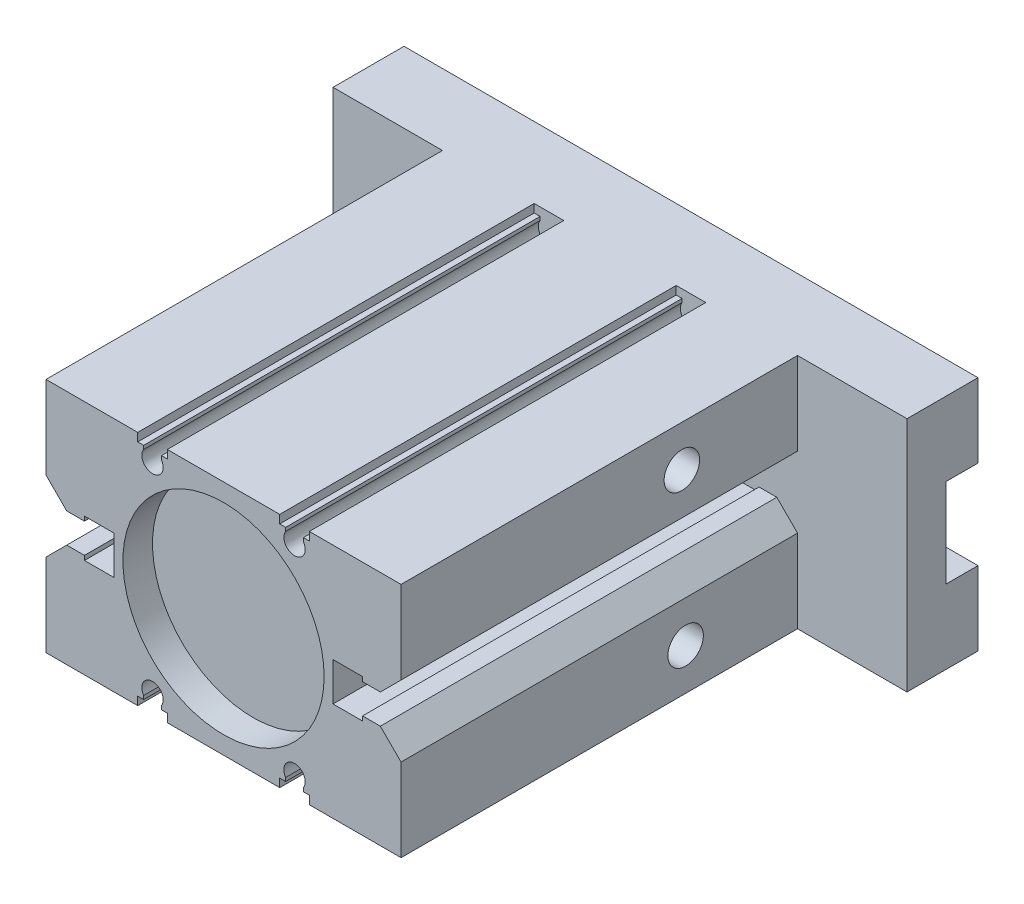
ISO-10303-21;
HEADER;
FILE_DESCRIPTION(('STEP AP214'),'2;1');
FILE_NAME('part.step','',(''),(''),'','','');
FILE_SCHEMA(('AUTOMOTIVE_DESIGN { 1 0 10303 214 1 1 1 1 }'));
ENDSEC;
DATA;
#1=APPLICATION_CONTEXT('core data for automotive mechanical design processes');
#2=APPLICATION_PROTOCOL_DEFINITION('international standard','automotive_design',2000,#1);
#3=PRODUCT_CONTEXT('',#1,'mechanical');
#4=PRODUCT('Part','Part','',(#3));
#5=PRODUCT_RELATED_PRODUCT_CATEGORY('part','',(#4));
#6=PRODUCT_DEFINITION_FORMATION('','',#4);
#7=PRODUCT_DEFINITION_CONTEXT('part definition',#1,'design');
#8=PRODUCT_DEFINITION('design','',#6,#7);
#9=PRODUCT_DEFINITION_SHAPE('','',#8);
#10=(LENGTH_UNIT() NAMED_UNIT(*) SI_UNIT(.MILLI.,.METRE.));
#11=(NAMED_UNIT(*) PLANE_ANGLE_UNIT() SI_UNIT($,.RADIAN.));
#12=(NAMED_UNIT(*) SI_UNIT($,.STERADIAN.) SOLID_ANGLE_UNIT());
#13=UNCERTAINTY_MEASURE_WITH_UNIT(LENGTH_MEASURE(1.E-05),#10,'distance_accuracy_value','');
#14=(GEOMETRIC_REPRESENTATION_CONTEXT(3) GLOBAL_UNCERTAINTY_ASSIGNED_CONTEXT((#13)) GLOBAL_UNIT_ASSIGNED_CONTEXT((#10,
#11,#12)) REPRESENTATION_CONTEXT('',''));
#15=CARTESIAN_POINT('',(0.,0.,0.));
#16=DIRECTION('',(0.,0.,1.));
#17=DIRECTION('',(1.,0.,0.));
#18=AXIS2_PLACEMENT_3D('',#15,#16,#17);
#19=CARTESIAN_POINT('',(0.,0.,-12.));
#20=DIRECTION('',(0.,0.,-1.));
#21=DIRECTION('',(-1.,0.,0.));
#22=AXIS2_PLACEMENT_3D('',#19,#20,#21);
#23=PLANE('',#22);
#24=DIRECTION('',(-1.,0.,0.));
#25=VECTOR('',#24,1.);
#26=CARTESIAN_POINT('',(48.5,7.5,-12.));
#27=LINE('',#26,#25);
#28=CARTESIAN_POINT('',(48.5,7.5,-12.));
#29=VERTEX_POINT('',#28);
#30=CARTESIAN_POINT('',(-48.5,7.5,-12.));
#31=VERTEX_POINT('',#30);
#32=EDGE_CURVE('E474',#29,#31,#27,.T.);
#33=ORIENTED_EDGE('',*,*,#32,.T.);
#34=DIRECTION('',(0.,1.,0.));
#35=VECTOR('',#34,1.);
#36=CARTESIAN_POINT('',(-48.5,20.,-12.));
#37=LINE('',#36,#35);
#38=CARTESIAN_POINT('',(-48.5,20.,-12.));
#39=VERTEX_POINT('',#38);
#40=EDGE_CURVE('E484',#31,#39,#37,.T.);
#41=ORIENTED_EDGE('',*,*,#40,.T.);
#42=DIRECTION('',(1.,0.,0.));
#43=VECTOR('',#42,1.);
#44=CARTESIAN_POINT('',(48.5,20.,-12.));
#45=LINE('',#44,#43);
#46=CARTESIAN_POINT('',(48.5,20.,-12.));
#47=VERTEX_POINT('',#46);
#48=EDGE_CURVE('E482',#39,#47,#45,.T.);
#49=ORIENTED_EDGE('',*,*,#48,.T.);
#50=DIRECTION('',(0.,-1.,0.));
#51=VECTOR('',#50,1.);
#52=CARTESIAN_POINT('',(48.5,20.,-12.));
#53=LINE('',#52,#51);
#54=EDGE_CURVE('E490',#47,#29,#53,.T.);
#55=ORIENTED_EDGE('',*,*,#54,.T.);
#56=EDGE_LOOP('',(#33,#41,#49,#55));
#57=FACE_BOUND('',#56,.T.);
#58=ADVANCED_FACE('F41',(#57),#23,.T.);
#59=CARTESIAN_POINT('',(30.,20.,67.));
#60=DIRECTION('',(-1.,0.,0.));
#61=DIRECTION('',(0.,-1.,0.));
#62=AXIS2_PLACEMENT_3D('',#59,#60,#61);
#63=PLANE('',#62);
#64=CARTESIAN_POINT('',(30.,13.,19.5465462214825));
#65=DIRECTION('',(1.,0.,0.));
#66=DIRECTION('',(0.,1.,0.));
#67=AXIS2_PLACEMENT_3D('',#64,#65,#66);
#68=CIRCLE('',#67,3.);
#69=CARTESIAN_POINT('',(30.,16.,19.5465462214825));
#70=VERTEX_POINT('',#69);
#71=EDGE_CURVE('E1224',#70,#70,#68,.T.);
#72=ORIENTED_EDGE('',*,*,#71,.F.);
#73=EDGE_LOOP('',(#72));
#74=FACE_BOUND('',#73,.T.);
#75=DIRECTION('',(0.,1.,0.));
#76=VECTOR('',#75,1.);
#77=CARTESIAN_POINT('',(30.,20.,67.));
#78=LINE('',#77,#76);
#79=CARTESIAN_POINT('',(30.,6.00000000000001,67.));
#80=VERTEX_POINT('',#79);
#81=CARTESIAN_POINT('',(30.,20.,67.));
#82=VERTEX_POINT('',#81);
#83=EDGE_CURVE('E910',#80,#82,#78,.T.);
#84=ORIENTED_EDGE('',*,*,#83,.F.);
#85=DIRECTION('',(0.,0.,1.));
#86=VECTOR('',#85,1.);
#87=CARTESIAN_POINT('',(30.,6.00000000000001,0.));
#88=LINE('',#87,#86);
#89=CARTESIAN_POINT('',(30.,6.00000000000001,0.));
#90=VERTEX_POINT('',#89);
#91=EDGE_CURVE('E594',#90,#80,#88,.T.);
#92=ORIENTED_EDGE('',*,*,#91,.F.);
#93=DIRECTION('',(0.,1.,0.));
#94=VECTOR('',#93,1.);
#95=CARTESIAN_POINT('',(30.,20.,0.));
#96=LINE('',#95,#94);
#97=CARTESIAN_POINT('',(30.,20.,0.));
#98=VERTEX_POINT('',#97);
#99=EDGE_CURVE('E582',#90,#98,#96,.T.);
#100=ORIENTED_EDGE('',*,*,#99,.T.);
#101=DIRECTION('',(0.,0.,-1.));
#102=VECTOR('',#101,1.);
#103=CARTESIAN_POINT('',(30.,20.,67.));
#104=LINE('',#103,#102);
#105=EDGE_CURVE('E11',#82,#98,#104,.T.);
#106=ORIENTED_EDGE('',*,*,#105,.F.);
#107=EDGE_LOOP('',(#84,#92,#100,#106));
#108=FACE_BOUND('',#107,.T.);
#109=ADVANCED_FACE('F1026',(#74,#108),#63,.F.);
#110=CARTESIAN_POINT('',(-30.,20.,67.));
#111=DIRECTION('',(1.,0.,0.));
#112=DIRECTION('',(0.,1.,0.));
#113=AXIS2_PLACEMENT_3D('',#110,#111,#112);
#114=PLANE('',#113);
#115=CARTESIAN_POINT('',(-30.,13.9009702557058,56.7641016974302));
#116=DIRECTION('',(-1.,0.,0.));
#117=DIRECTION('',(0.,-1.,0.));
#118=AXIS2_PLACEMENT_3D('',#115,#116,#117);
#119=CIRCLE('',#118,3.);
#120=CARTESIAN_POINT('',(-30.,10.9009702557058,56.7641016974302));
#121=VERTEX_POINT('',#120);
#122=EDGE_CURVE('E1233',#121,#121,#119,.T.);
#123=ORIENTED_EDGE('',*,*,#122,.F.);
#124=EDGE_LOOP('',(#123));
#125=FACE_BOUND('',#124,.T.);
#126=DIRECTION('',(0.,-1.,0.));
#127=VECTOR('',#126,1.);
#128=CARTESIAN_POINT('',(-30.,20.,0.));
#129=LINE('',#128,#127);
#130=CARTESIAN_POINT('',(-30.,20.,0.));
#131=VERTEX_POINT('',#130);
#132=CARTESIAN_POINT('',(-30.,6.00000000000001,0.));
#133=VERTEX_POINT('',#132);
#134=EDGE_CURVE('E924',#131,#133,#129,.T.);
#135=ORIENTED_EDGE('',*,*,#134,.T.);
#136=DIRECTION('',(0.,0.,1.));
#137=VECTOR('',#136,1.);
#138=CARTESIAN_POINT('',(-30.,6.00000000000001,0.));
#139=LINE('',#138,#137);
#140=CARTESIAN_POINT('',(-30.,6.00000000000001,67.));
#141=VERTEX_POINT('',#140);
#142=EDGE_CURVE('E774',#133,#141,#139,.T.);
#143=ORIENTED_EDGE('',*,*,#142,.T.);
#144=DIRECTION('',(0.,-1.,0.));
#145=VECTOR('',#144,1.);
#146=CARTESIAN_POINT('',(-30.,20.,67.));
#147=LINE('',#146,#145);
#148=CARTESIAN_POINT('',(-30.,20.,67.));
#149=VERTEX_POINT('',#148);
#150=EDGE_CURVE('E911',#149,#141,#147,.T.);
#151=ORIENTED_EDGE('',*,*,#150,.F.);
#152=DIRECTION('',(0.,0.,-1.));
#153=VECTOR('',#152,1.);
#154=CARTESIAN_POINT('',(-30.,20.,67.));
#155=LINE('',#154,#153);
#156=EDGE_CURVE('E47',#149,#131,#155,.T.);
#157=ORIENTED_EDGE('',*,*,#156,.T.);
#158=EDGE_LOOP('',(#135,#143,#151,#157));
#159=FACE_BOUND('',#158,.T.);
#160=ADVANCED_FACE('F934',(#125,#159),#114,.F.);
#161=CARTESIAN_POINT('',(30.,-13.,18.909570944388));
#162=DIRECTION('',(1.,0.,0.));
#163=DIRECTION('',(0.,1.,0.));
#164=AXIS2_PLACEMENT_3D('',#161,#162,#163);
#165=CIRCLE('',#164,3.);
#166=CARTESIAN_POINT('',(30.,-9.99999999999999,18.909570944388));
#167=VERTEX_POINT('',#166);
#168=EDGE_CURVE('E1221',#167,#167,#165,.T.);
#169=ORIENTED_EDGE('',*,*,#168,.F.);
#170=EDGE_LOOP('',(#169));
#171=FACE_BOUND('',#170,.T.);
#172=CARTESIAN_POINT('',(30.,-20.,0.));
#173=VERTEX_POINT('',#172);
#174=CARTESIAN_POINT('',(30.,-6.00000000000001,0.));
#175=VERTEX_POINT('',#174);
#176=EDGE_CURVE('E925',#173,#175,#96,.T.);
#177=ORIENTED_EDGE('',*,*,#176,.T.);
#178=DIRECTION('',(0.,0.,1.));
#179=VECTOR('',#178,1.);
#180=CARTESIAN_POINT('',(30.,-6.00000000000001,0.));
#181=LINE('',#180,#179);
#182=CARTESIAN_POINT('',(30.,-6.00000000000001,67.));
#183=VERTEX_POINT('',#182);
#184=EDGE_CURVE('E600',#175,#183,#181,.T.);
#185=ORIENTED_EDGE('',*,*,#184,.T.);
#186=CARTESIAN_POINT('',(30.,-20.,67.));
#187=VERTEX_POINT('',#186);
#188=EDGE_CURVE('E905',#187,#183,#78,.T.);
#189=ORIENTED_EDGE('',*,*,#188,.F.);
#190=DIRECTION('',(0.,0.,-1.));
#191=VECTOR('',#190,1.);
#192=CARTESIAN_POINT('',(30.,-20.,67.));
#193=LINE('',#192,#191);
#194=EDGE_CURVE('E917',#187,#173,#193,.T.);
#195=ORIENTED_EDGE('',*,*,#194,.T.);
#196=EDGE_LOOP('',(#177,#185,#189,#195));
#197=FACE_BOUND('',#196,.T.);
#198=ADVANCED_FACE('F43',(#171,#197),#63,.F.);
#199=CARTESIAN_POINT('',(-30.,20.,67.));
#200=DIRECTION('',(0.,-1.,0.));
#201=DIRECTION('',(0.,0.,-1.));
#202=AXIS2_PLACEMENT_3D('',#199,#200,#201);
#203=PLANE('',#202);
#204=ORIENTED_EDGE('',*,*,#105,.T.);
#205=DIRECTION('',(1.,0.,0.));
#206=VECTOR('',#205,1.);
#207=CARTESIAN_POINT('',(48.5,20.,0.));
#208=LINE('',#207,#206);
#209=CARTESIAN_POINT('',(48.5,20.,0.));
#210=VERTEX_POINT('',#209);
#211=EDGE_CURVE('E494',#98,#210,#208,.T.);
#212=ORIENTED_EDGE('',*,*,#211,.T.);
#213=DIRECTION('',(0.,0.,1.));
#214=VECTOR('',#213,1.);
#215=CARTESIAN_POINT('',(48.5,20.,-12.));
#216=LINE('',#215,#214);
#217=EDGE_CURVE('E515',#47,#210,#216,.T.);
#218=ORIENTED_EDGE('',*,*,#217,.F.);
#219=ORIENTED_EDGE('',*,*,#48,.F.);
#220=DIRECTION('',(0.,0.,1.));
#221=VECTOR('',#220,1.);
#222=CARTESIAN_POINT('',(-48.5,20.,-12.));
#223=LINE('',#222,#221);
#224=CARTESIAN_POINT('',(-48.5,20.,0.));
#225=VERTEX_POINT('',#224);
#226=EDGE_CURVE('E513',#39,#225,#223,.T.);
#227=ORIENTED_EDGE('',*,*,#226,.T.);
#228=EDGE_CURVE('E497',#225,#131,#208,.T.);
#229=ORIENTED_EDGE('',*,*,#228,.T.);
#230=ORIENTED_EDGE('',*,*,#156,.F.);
#231=DIRECTION('',(-1.,0.,0.));
#232=VECTOR('',#231,1.);
#233=CARTESIAN_POINT('',(-30.,20.,67.));
#234=LINE('',#233,#232);
#235=CARTESIAN_POINT('',(-14.5,20.,67.));
#236=VERTEX_POINT('',#235);
#237=EDGE_CURVE('E908',#236,#149,#234,.T.);
#238=ORIENTED_EDGE('',*,*,#237,.F.);
#239=DIRECTION('',(0.,0.,1.));
#240=VECTOR('',#239,1.);
#241=CARTESIAN_POINT('',(-14.5,20.,0.));
#242=LINE('',#241,#240);
#243=CARTESIAN_POINT('',(-14.5,20.,0.));
#244=VERTEX_POINT('',#243);
#245=EDGE_CURVE('E730',#244,#236,#242,.T.);
#246=ORIENTED_EDGE('',*,*,#245,.F.);
#247=CARTESIAN_POINT('',(-9.49999999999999,20.,0.));
#248=VERTEX_POINT('',#247);
#249=EDGE_CURVE('E498',#244,#248,#208,.T.);
#250=ORIENTED_EDGE('',*,*,#249,.T.);
#251=DIRECTION('',(0.,0.,1.));
#252=VECTOR('',#251,1.);
#253=CARTESIAN_POINT('',(-9.49999999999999,20.,0.));
#254=LINE('',#253,#252);
#255=CARTESIAN_POINT('',(-9.49999999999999,20.,67.));
#256=VERTEX_POINT('',#255);
#257=EDGE_CURVE('E723',#248,#256,#254,.T.);
#258=ORIENTED_EDGE('',*,*,#257,.T.);
#259=CARTESIAN_POINT('',(9.5,20.,67.));
#260=VERTEX_POINT('',#259);
#261=EDGE_CURVE('E912',#260,#256,#234,.T.);
#262=ORIENTED_EDGE('',*,*,#261,.F.);
#263=DIRECTION('',(0.,0.,1.));
#264=VECTOR('',#263,1.);
#265=CARTESIAN_POINT('',(9.5,20.,0.));
#266=LINE('',#265,#264);
#267=CARTESIAN_POINT('',(9.5,20.,0.));
#268=VERTEX_POINT('',#267);
#269=EDGE_CURVE('E614',#268,#260,#266,.T.);
#270=ORIENTED_EDGE('',*,*,#269,.F.);
#271=CARTESIAN_POINT('',(14.5,20.,0.));
#272=VERTEX_POINT('',#271);
#273=EDGE_CURVE('E1031',#268,#272,#208,.T.);
#274=ORIENTED_EDGE('',*,*,#273,.T.);
#275=DIRECTION('',(0.,0.,1.));
#276=VECTOR('',#275,1.);
#277=CARTESIAN_POINT('',(14.5,20.,0.));
#278=LINE('',#277,#276);
#279=CARTESIAN_POINT('',(14.5,20.,67.));
#280=VERTEX_POINT('',#279);
#281=EDGE_CURVE('E609',#272,#280,#278,.T.);
#282=ORIENTED_EDGE('',*,*,#281,.T.);
#283=EDGE_CURVE('E906',#82,#280,#234,.T.);
#284=ORIENTED_EDGE('',*,*,#283,.F.);
#285=EDGE_LOOP('',(#204,#212,#218,#219,#227,#229,#230,#238,#246,#250,#258,#262,#270,#274,#282,#284));
#286=FACE_BOUND('',#285,.T.);
#287=ADVANCED_FACE('F941',(#286),#203,.F.);
#288=CARTESIAN_POINT('',(-30.,-12.9429878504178,36.7641016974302));
#289=DIRECTION('',(-1.,0.,0.));
#290=DIRECTION('',(0.,-1.,0.));
#291=AXIS2_PLACEMENT_3D('',#288,#289,#290);
#292=CIRCLE('',#291,3.);
#293=CARTESIAN_POINT('',(-30.,-15.9429878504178,36.7641016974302));
#294=VERTEX_POINT('',#293);
#295=EDGE_CURVE('E1240',#294,#294,#292,.T.);
#296=ORIENTED_EDGE('',*,*,#295,.F.);
#297=EDGE_LOOP('',(#296));
#298=FACE_BOUND('',#297,.T.);
#299=CARTESIAN_POINT('',(-30.,-6.00000000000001,67.));
#300=VERTEX_POINT('',#299);
#301=CARTESIAN_POINT('',(-30.,-20.,67.));
#302=VERTEX_POINT('',#301);
#303=EDGE_CURVE('E913',#300,#302,#147,.T.);
#304=ORIENTED_EDGE('',*,*,#303,.F.);
#305=DIRECTION('',(0.,0.,1.));
#306=VECTOR('',#305,1.);
#307=CARTESIAN_POINT('',(-30.,-6.00000000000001,0.));
#308=LINE('',#307,#306);
#309=CARTESIAN_POINT('',(-30.,-6.00000000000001,0.));
#310=VERTEX_POINT('',#309);
#311=EDGE_CURVE('E776',#310,#300,#308,.T.);
#312=ORIENTED_EDGE('',*,*,#311,.F.);
#313=CARTESIAN_POINT('',(-30.,-20.,0.));
#314=VERTEX_POINT('',#313);
#315=EDGE_CURVE('E922',#310,#314,#129,.T.);
#316=ORIENTED_EDGE('',*,*,#315,.T.);
#317=DIRECTION('',(0.,0.,-1.));
#318=VECTOR('',#317,1.);
#319=CARTESIAN_POINT('',(-30.,-20.,67.));
#320=LINE('',#319,#318);
#321=EDGE_CURVE('E927',#302,#314,#320,.T.);
#322=ORIENTED_EDGE('',*,*,#321,.F.);
#323=EDGE_LOOP('',(#304,#312,#316,#322));
#324=FACE_BOUND('',#323,.T.);
#325=ADVANCED_FACE('F1203',(#298,#324),#114,.F.);
#326=CARTESIAN_POINT('',(-30.,-20.,67.));
#327=DIRECTION('',(0.,1.,0.));
#328=DIRECTION('',(0.,0.,1.));
#329=AXIS2_PLACEMENT_3D('',#326,#327,#328);
#330=PLANE('',#329);
#331=ORIENTED_EDGE('',*,*,#321,.T.);
#332=DIRECTION('',(-1.,0.,0.));
#333=VECTOR('',#332,1.);
#334=CARTESIAN_POINT('',(48.5,-20.,0.));
#335=LINE('',#334,#333);
#336=CARTESIAN_POINT('',(-48.5,-20.,0.));
#337=VERTEX_POINT('',#336);
#338=EDGE_CURVE('E501',#314,#337,#335,.T.);
#339=ORIENTED_EDGE('',*,*,#338,.T.);
#340=DIRECTION('',(0.,0.,1.));
#341=VECTOR('',#340,1.);
#342=CARTESIAN_POINT('',(-48.5,-20.,-12.));
#343=LINE('',#342,#341);
#344=CARTESIAN_POINT('',(-48.5,-20.,-12.));
#345=VERTEX_POINT('',#344);
#346=EDGE_CURVE('E495',#345,#337,#343,.T.);
#347=ORIENTED_EDGE('',*,*,#346,.F.);
#348=DIRECTION('',(-1.,0.,0.));
#349=VECTOR('',#348,1.);
#350=CARTESIAN_POINT('',(48.5,-20.,-12.));
#351=LINE('',#350,#349);
#352=CARTESIAN_POINT('',(48.5,-20.,-12.));
#353=VERTEX_POINT('',#352);
#354=EDGE_CURVE('E489',#353,#345,#351,.T.);
#355=ORIENTED_EDGE('',*,*,#354,.F.);
#356=DIRECTION('',(0.,0.,1.));
#357=VECTOR('',#356,1.);
#358=CARTESIAN_POINT('',(48.5,-20.,-12.));
#359=LINE('',#358,#357);
#360=CARTESIAN_POINT('',(48.5,-20.,0.));
#361=VERTEX_POINT('',#360);
#362=EDGE_CURVE('E507',#353,#361,#359,.T.);
#363=ORIENTED_EDGE('',*,*,#362,.T.);
#364=EDGE_CURVE('E505',#361,#173,#335,.T.);
#365=ORIENTED_EDGE('',*,*,#364,.T.);
#366=ORIENTED_EDGE('',*,*,#194,.F.);
#367=DIRECTION('',(1.,0.,0.));
#368=VECTOR('',#367,1.);
#369=CARTESIAN_POINT('',(-30.,-20.,67.));
#370=LINE('',#369,#368);
#371=CARTESIAN_POINT('',(14.5,-20.,67.));
#372=VERTEX_POINT('',#371);
#373=EDGE_CURVE('E918',#372,#187,#370,.T.);
#374=ORIENTED_EDGE('',*,*,#373,.F.);
#375=DIRECTION('',(0.,0.,1.));
#376=VECTOR('',#375,1.);
#377=CARTESIAN_POINT('',(14.5,-20.,0.));
#378=LINE('',#377,#376);
#379=CARTESIAN_POINT('',(14.5,-20.,0.));
#380=VERTEX_POINT('',#379);
#381=EDGE_CURVE('E846',#380,#372,#378,.T.);
#382=ORIENTED_EDGE('',*,*,#381,.F.);
#383=CARTESIAN_POINT('',(9.5,-20.,0.));
#384=VERTEX_POINT('',#383);
#385=EDGE_CURVE('E508',#380,#384,#335,.T.);
#386=ORIENTED_EDGE('',*,*,#385,.T.);
#387=DIRECTION('',(0.,0.,1.));
#388=VECTOR('',#387,1.);
#389=CARTESIAN_POINT('',(9.5,-20.,0.));
#390=LINE('',#389,#388);
#391=CARTESIAN_POINT('',(9.5,-20.,67.));
#392=VERTEX_POINT('',#391);
#393=EDGE_CURVE('E700',#384,#392,#390,.T.);
#394=ORIENTED_EDGE('',*,*,#393,.T.);
#395=CARTESIAN_POINT('',(-9.49999999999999,-20.,67.));
#396=VERTEX_POINT('',#395);
#397=EDGE_CURVE('E921',#396,#392,#370,.T.);
#398=ORIENTED_EDGE('',*,*,#397,.F.);
#399=DIRECTION('',(0.,0.,1.));
#400=VECTOR('',#399,1.);
#401=CARTESIAN_POINT('',(-9.49999999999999,-20.,0.));
#402=LINE('',#401,#400);
#403=CARTESIAN_POINT('',(-9.49999999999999,-20.,0.));
#404=VERTEX_POINT('',#403);
#405=EDGE_CURVE('E666',#404,#396,#402,.T.);
#406=ORIENTED_EDGE('',*,*,#405,.F.);
#407=CARTESIAN_POINT('',(-14.5,-20.,0.));
#408=VERTEX_POINT('',#407);
#409=EDGE_CURVE('E954',#404,#408,#335,.T.);
#410=ORIENTED_EDGE('',*,*,#409,.T.);
#411=DIRECTION('',(0.,0.,1.));
#412=VECTOR('',#411,1.);
#413=CARTESIAN_POINT('',(-14.5,-20.,0.));
#414=LINE('',#413,#412);
#415=CARTESIAN_POINT('',(-14.5,-20.,67.));
#416=VERTEX_POINT('',#415);
#417=EDGE_CURVE('E661',#408,#416,#414,.T.);
#418=ORIENTED_EDGE('',*,*,#417,.T.);
#419=EDGE_CURVE('E920',#302,#416,#370,.T.);
#420=ORIENTED_EDGE('',*,*,#419,.F.);
#421=EDGE_LOOP('',(#331,#339,#347,#355,#363,#365,#366,#374,#382,#386,#394,#398,#406,#410,#418,#420));
#422=FACE_BOUND('',#421,.T.);
#423=ADVANCED_FACE('F963',(#422),#330,.F.);
#424=CARTESIAN_POINT('',(0.,0.,67.));
#425=DIRECTION('',(0.,0.,1.));
#426=DIRECTION('',(1.,0.,0.));
#427=AXIS2_PLACEMENT_3D('',#424,#425,#426);
#428=PLANE('',#427);
#429=CARTESIAN_POINT('',(0.,0.,67.));
#430=DIRECTION('',(0.,0.,1.));
#431=DIRECTION('',(1.,0.,0.));
#432=AXIS2_PLACEMENT_3D('',#429,#430,#431);
#433=CIRCLE('',#432,17.);
#434=CARTESIAN_POINT('',(17.,0.,67.));
#435=VERTEX_POINT('',#434);
#436=EDGE_CURVE('E520',#435,#435,#433,.T.);
#437=ORIENTED_EDGE('',*,*,#436,.F.);
#438=EDGE_LOOP('',(#437));
#439=FACE_BOUND('',#438,.T.);
#440=DIRECTION('',(-0.707106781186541,-0.707106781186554,0.));
#441=VECTOR('',#440,1.);
#442=CARTESIAN_POINT('',(26.5,2.49999999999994,67.));
#443=LINE('',#442,#441);
#444=CARTESIAN_POINT('',(26.5,2.49999999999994,67.));
#445=VERTEX_POINT('',#444);
#446=EDGE_CURVE('E557',#80,#445,#443,.T.);
#447=ORIENTED_EDGE('',*,*,#446,.F.);
#448=ORIENTED_EDGE('',*,*,#83,.T.);
#449=ORIENTED_EDGE('',*,*,#283,.T.);
#450=DIRECTION('',(0.,1.,0.));
#451=VECTOR('',#450,1.);
#452=CARTESIAN_POINT('',(14.5,18.6,67.));
#453=LINE('',#452,#451);
#454=CARTESIAN_POINT('',(14.5,18.6,67.));
#455=VERTEX_POINT('',#454);
#456=EDGE_CURVE('E630',#455,#280,#453,.T.);
#457=ORIENTED_EDGE('',*,*,#456,.F.);
#458=DIRECTION('',(1.,0.,0.));
#459=VECTOR('',#458,1.);
#460=CARTESIAN_POINT('',(13.5,18.6,67.));
#461=LINE('',#460,#459);
#462=CARTESIAN_POINT('',(13.5,18.6,67.));
#463=VERTEX_POINT('',#462);
#464=EDGE_CURVE('E627',#463,#455,#461,.T.);
#465=ORIENTED_EDGE('',*,*,#464,.F.);
#466=DIRECTION('',(0.,1.,0.));
#467=VECTOR('',#466,1.);
#468=CARTESIAN_POINT('',(13.5,18.,67.));
#469=LINE('',#468,#467);
#470=CARTESIAN_POINT('',(13.5,18.,67.));
#471=VERTEX_POINT('',#470);
#472=EDGE_CURVE('E631',#471,#463,#469,.T.);
#473=ORIENTED_EDGE('',*,*,#472,.F.);
#474=CARTESIAN_POINT('',(12.,17.,67.));
#475=DIRECTION('',(0.,0.,1.));
#476=DIRECTION('',(-1.,0.,0.));
#477=AXIS2_PLACEMENT_3D('',#474,#475,#476);
#478=CIRCLE('',#477,1.80277563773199);
#479=CARTESIAN_POINT('',(10.5,18.,67.));
#480=VERTEX_POINT('',#479);
#481=EDGE_CURVE('E638',#480,#471,#478,.T.);
#482=ORIENTED_EDGE('',*,*,#481,.F.);
#483=DIRECTION('',(0.,-1.,0.));
#484=VECTOR('',#483,1.);
#485=CARTESIAN_POINT('',(10.5,18.6,67.));
#486=LINE('',#485,#484);
#487=CARTESIAN_POINT('',(10.5,18.6,67.));
#488=VERTEX_POINT('',#487);
#489=EDGE_CURVE('E616',#488,#480,#486,.T.);
#490=ORIENTED_EDGE('',*,*,#489,.F.);
#491=DIRECTION('',(1.,0.,0.));
#492=VECTOR('',#491,1.);
#493=CARTESIAN_POINT('',(9.5,18.6,67.));
#494=LINE('',#493,#492);
#495=CARTESIAN_POINT('',(9.5,18.6,67.));
#496=VERTEX_POINT('',#495);
#497=EDGE_CURVE('E622',#496,#488,#494,.T.);
#498=ORIENTED_EDGE('',*,*,#497,.F.);
#499=DIRECTION('',(0.,-1.,0.));
#500=VECTOR('',#499,1.);
#501=CARTESIAN_POINT('',(9.5,20.,67.));
#502=LINE('',#501,#500);
#503=EDGE_CURVE('E623',#260,#496,#502,.T.);
#504=ORIENTED_EDGE('',*,*,#503,.F.);
#505=ORIENTED_EDGE('',*,*,#261,.T.);
#506=DIRECTION('',(0.,1.,0.));
#507=VECTOR('',#506,1.);
#508=CARTESIAN_POINT('',(-9.49999999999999,20.,67.));
#509=LINE('',#508,#507);
#510=CARTESIAN_POINT('',(-9.49999999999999,18.6,67.));
#511=VERTEX_POINT('',#510);
#512=EDGE_CURVE('E742',#511,#256,#509,.T.);
#513=ORIENTED_EDGE('',*,*,#512,.F.);
#514=DIRECTION('',(1.,0.,0.));
#515=VECTOR('',#514,1.);
#516=CARTESIAN_POINT('',(-9.49999999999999,18.6,67.));
#517=LINE('',#516,#515);
#518=CARTESIAN_POINT('',(-10.5,18.6,67.));
#519=VERTEX_POINT('',#518);
#520=EDGE_CURVE('E748',#519,#511,#517,.T.);
#521=ORIENTED_EDGE('',*,*,#520,.F.);
#522=DIRECTION('',(0.,1.,0.));
#523=VECTOR('',#522,1.);
#524=CARTESIAN_POINT('',(-10.5,18.6,67.));
#525=LINE('',#524,#523);
#526=CARTESIAN_POINT('',(-10.5,18.,67.));
#527=VERTEX_POINT('',#526);
#528=EDGE_CURVE('E750',#527,#519,#525,.T.);
#529=ORIENTED_EDGE('',*,*,#528,.F.);
#530=CARTESIAN_POINT('',(-12.,17.,67.));
#531=DIRECTION('',(0.,0.,1.));
#532=DIRECTION('',(1.,0.,0.));
#533=AXIS2_PLACEMENT_3D('',#530,#531,#532);
#534=CIRCLE('',#533,1.80277563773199);
#535=CARTESIAN_POINT('',(-13.5,18.,67.));
#536=VERTEX_POINT('',#535);
#537=EDGE_CURVE('E674',#536,#527,#534,.T.);
#538=ORIENTED_EDGE('',*,*,#537,.F.);
#539=DIRECTION('',(0.,-1.,0.));
#540=VECTOR('',#539,1.);
#541=CARTESIAN_POINT('',(-13.5,18.,67.));
#542=LINE('',#541,#540);
#543=CARTESIAN_POINT('',(-13.5,18.6,67.));
#544=VERTEX_POINT('',#543);
#545=EDGE_CURVE('E734',#544,#536,#542,.T.);
#546=ORIENTED_EDGE('',*,*,#545,.F.);
#547=DIRECTION('',(1.,0.,0.));
#548=VECTOR('',#547,1.);
#549=CARTESIAN_POINT('',(-13.5,18.6,67.));
#550=LINE('',#549,#548);
#551=CARTESIAN_POINT('',(-14.5,18.6,67.));
#552=VERTEX_POINT('',#551);
#553=EDGE_CURVE('E736',#552,#544,#550,.T.);
#554=ORIENTED_EDGE('',*,*,#553,.F.);
#555=DIRECTION('',(0.,-1.,0.));
#556=VECTOR('',#555,1.);
#557=CARTESIAN_POINT('',(-14.5,18.6,67.));
#558=LINE('',#557,#556);
#559=EDGE_CURVE('E743',#236,#552,#558,.T.);
#560=ORIENTED_EDGE('',*,*,#559,.F.);
#561=ORIENTED_EDGE('',*,*,#237,.T.);
#562=ORIENTED_EDGE('',*,*,#150,.T.);
#563=DIRECTION('',(-0.707106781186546,0.707106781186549,0.));
#564=VECTOR('',#563,1.);
#565=CARTESIAN_POINT('',(-26.5,2.5,67.));
#566=LINE('',#565,#564);
#567=CARTESIAN_POINT('',(-26.5,2.5,67.));
#568=VERTEX_POINT('',#567);
#569=EDGE_CURVE('E560',#568,#141,#566,.T.);
#570=ORIENTED_EDGE('',*,*,#569,.F.);
#571=DIRECTION('',(-1.,0.,0.));
#572=VECTOR('',#571,1.);
#573=CARTESIAN_POINT('',(-23.5,2.5,67.));
#574=LINE('',#573,#572);
#575=CARTESIAN_POINT('',(-23.5,2.5,67.));
#576=VERTEX_POINT('',#575);
#577=EDGE_CURVE('E798',#576,#568,#574,.T.);
#578=ORIENTED_EDGE('',*,*,#577,.F.);
#579=DIRECTION('',(0.,-1.,0.));
#580=VECTOR('',#579,1.);
#581=CARTESIAN_POINT('',(-23.5,3.25,67.));
#582=LINE('',#581,#580);
#583=CARTESIAN_POINT('',(-23.5,3.25,67.));
#584=VERTEX_POINT('',#583);
#585=EDGE_CURVE('E797',#584,#576,#582,.T.);
#586=ORIENTED_EDGE('',*,*,#585,.F.);
#587=DIRECTION('',(-1.,0.,0.));
#588=VECTOR('',#587,1.);
#589=CARTESIAN_POINT('',(-18.5,3.25,67.));
#590=LINE('',#589,#588);
#591=CARTESIAN_POINT('',(-18.5,3.25,67.));
#592=VERTEX_POINT('',#591);
#593=EDGE_CURVE('E801',#592,#584,#590,.T.);
#594=ORIENTED_EDGE('',*,*,#593,.F.);
#595=DIRECTION('',(0.,1.,0.));
#596=VECTOR('',#595,1.);
#597=CARTESIAN_POINT('',(-18.5,-3.25,67.));
#598=LINE('',#597,#596);
#599=CARTESIAN_POINT('',(-18.5,-3.25,67.));
#600=VERTEX_POINT('',#599);
#601=EDGE_CURVE('E808',#600,#592,#598,.T.);
#602=ORIENTED_EDGE('',*,*,#601,.F.);
#603=DIRECTION('',(1.,0.,0.));
#604=VECTOR('',#603,1.);
#605=CARTESIAN_POINT('',(-18.5,-3.25,67.));
#606=LINE('',#605,#604);
#607=CARTESIAN_POINT('',(-23.5,-3.25,67.));
#608=VERTEX_POINT('',#607);
#609=EDGE_CURVE('E809',#608,#600,#606,.T.);
#610=ORIENTED_EDGE('',*,*,#609,.F.);
#611=DIRECTION('',(0.,-1.,0.));
#612=VECTOR('',#611,1.);
#613=CARTESIAN_POINT('',(-23.5,-3.25,67.));
#614=LINE('',#613,#612);
#615=CARTESIAN_POINT('',(-23.5,-2.5,67.));
#616=VERTEX_POINT('',#615);
#617=EDGE_CURVE('E815',#616,#608,#614,.T.);
#618=ORIENTED_EDGE('',*,*,#617,.F.);
#619=DIRECTION('',(1.,0.,0.));
#620=VECTOR('',#619,1.);
#621=CARTESIAN_POINT('',(-23.5,-2.5,67.));
#622=LINE('',#621,#620);
#623=CARTESIAN_POINT('',(-26.5,-2.5,67.));
#624=VERTEX_POINT('',#623);
#625=EDGE_CURVE('E814',#624,#616,#622,.T.);
#626=ORIENTED_EDGE('',*,*,#625,.F.);
#627=DIRECTION('',(0.707106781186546,0.707106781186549,0.));
#628=VECTOR('',#627,1.);
#629=CARTESIAN_POINT('',(-26.5,-2.5,67.));
#630=LINE('',#629,#628);
#631=EDGE_CURVE('E818',#300,#624,#630,.T.);
#632=ORIENTED_EDGE('',*,*,#631,.F.);
#633=ORIENTED_EDGE('',*,*,#303,.T.);
#634=ORIENTED_EDGE('',*,*,#419,.T.);
#635=DIRECTION('',(0.,-1.,0.));
#636=VECTOR('',#635,1.);
#637=CARTESIAN_POINT('',(-14.5,-18.6,67.));
#638=LINE('',#637,#636);
#639=CARTESIAN_POINT('',(-14.5,-18.6,67.));
#640=VERTEX_POINT('',#639);
#641=EDGE_CURVE('E688',#640,#416,#638,.T.);
#642=ORIENTED_EDGE('',*,*,#641,.F.);
#643=DIRECTION('',(-1.,0.,0.));
#644=VECTOR('',#643,1.);
#645=CARTESIAN_POINT('',(-13.5,-18.6,67.));
#646=LINE('',#645,#644);
#647=CARTESIAN_POINT('',(-13.5,-18.6,67.));
#648=VERTEX_POINT('',#647);
#649=EDGE_CURVE('E686',#648,#640,#646,.T.);
#650=ORIENTED_EDGE('',*,*,#649,.F.);
#651=DIRECTION('',(0.,-1.,0.));
#652=VECTOR('',#651,1.);
#653=CARTESIAN_POINT('',(-13.5,-18.,67.));
#654=LINE('',#653,#652);
#655=CARTESIAN_POINT('',(-13.5,-18.,67.));
#656=VERTEX_POINT('',#655);
#657=EDGE_CURVE('E693',#656,#648,#654,.T.);
#658=ORIENTED_EDGE('',*,*,#657,.F.);
#659=CARTESIAN_POINT('',(-12.,-17.,67.));
#660=DIRECTION('',(0.,0.,1.));
#661=DIRECTION('',(-1.,0.,0.));
#662=AXIS2_PLACEMENT_3D('',#659,#660,#661);
#663=CIRCLE('',#662,1.80277563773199);
#664=CARTESIAN_POINT('',(-10.5,-18.,67.));
#665=VERTEX_POINT('',#664);
#666=EDGE_CURVE('E695',#665,#656,#663,.T.);
#667=ORIENTED_EDGE('',*,*,#666,.F.);
#668=DIRECTION('',(0.,1.,0.));
#669=VECTOR('',#668,1.);
#670=CARTESIAN_POINT('',(-10.5,-18.6,67.));
#671=LINE('',#670,#669);
#672=CARTESIAN_POINT('',(-10.5,-18.6,67.));
#673=VERTEX_POINT('',#672);
#674=EDGE_CURVE('E677',#673,#665,#671,.T.);
#675=ORIENTED_EDGE('',*,*,#674,.F.);
#676=DIRECTION('',(-1.,0.,0.));
#677=VECTOR('',#676,1.);
#678=CARTESIAN_POINT('',(-9.49999999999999,-18.6,67.));
#679=LINE('',#678,#677);
#680=CARTESIAN_POINT('',(-9.49999999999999,-18.6,67.));
#681=VERTEX_POINT('',#680);
#682=EDGE_CURVE('E679',#681,#673,#679,.T.);
#683=ORIENTED_EDGE('',*,*,#682,.F.);
#684=DIRECTION('',(0.,1.,0.));
#685=VECTOR('',#684,1.);
#686=CARTESIAN_POINT('',(-9.49999999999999,-20.,67.));
#687=LINE('',#686,#685);
#688=EDGE_CURVE('E685',#396,#681,#687,.T.);
#689=ORIENTED_EDGE('',*,*,#688,.F.);
#690=ORIENTED_EDGE('',*,*,#397,.T.);
#691=DIRECTION('',(0.,-1.,0.));
#692=VECTOR('',#691,1.);
#693=CARTESIAN_POINT('',(9.5,-20.,67.));
#694=LINE('',#693,#692);
#695=CARTESIAN_POINT('',(9.5,-18.6,67.));
#696=VERTEX_POINT('',#695);
#697=EDGE_CURVE('E864',#696,#392,#694,.T.);
#698=ORIENTED_EDGE('',*,*,#697,.F.);
#699=DIRECTION('',(-1.,0.,0.));
#700=VECTOR('',#699,1.);
#701=CARTESIAN_POINT('',(9.5,-18.6,67.));
#702=LINE('',#701,#700);
#703=CARTESIAN_POINT('',(10.5,-18.6,67.));
#704=VERTEX_POINT('',#703);
#705=EDGE_CURVE('E866',#704,#696,#702,.T.);
#706=ORIENTED_EDGE('',*,*,#705,.F.);
#707=DIRECTION('',(0.,-1.,0.));
#708=VECTOR('',#707,1.);
#709=CARTESIAN_POINT('',(10.5,-18.6,67.));
#710=LINE('',#709,#708);
#711=CARTESIAN_POINT('',(10.5,-18.,67.));
#712=VERTEX_POINT('',#711);
#713=EDGE_CURVE('E869',#712,#704,#710,.T.);
#714=ORIENTED_EDGE('',*,*,#713,.F.);
#715=CARTESIAN_POINT('',(12.,-17.,67.));
#716=DIRECTION('',(0.,0.,1.));
#717=DIRECTION('',(1.,0.,0.));
#718=AXIS2_PLACEMENT_3D('',#715,#716,#717);
#719=CIRCLE('',#718,1.80277563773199);
#720=CARTESIAN_POINT('',(13.5,-18.,67.));
#721=VERTEX_POINT('',#720);
#722=EDGE_CURVE('E873',#721,#712,#719,.T.);
#723=ORIENTED_EDGE('',*,*,#722,.F.);
#724=DIRECTION('',(0.,1.,0.));
#725=VECTOR('',#724,1.);
#726=CARTESIAN_POINT('',(13.5,-18.,67.));
#727=LINE('',#726,#725);
#728=CARTESIAN_POINT('',(13.5,-18.6,67.));
#729=VERTEX_POINT('',#728);
#730=EDGE_CURVE('E876',#729,#721,#727,.T.);
#731=ORIENTED_EDGE('',*,*,#730,.F.);
#732=DIRECTION('',(-1.,0.,0.));
#733=VECTOR('',#732,1.);
#734=CARTESIAN_POINT('',(13.5,-18.6,67.));
#735=LINE('',#734,#733);
#736=CARTESIAN_POINT('',(14.5,-18.6,67.));
#737=VERTEX_POINT('',#736);
#738=EDGE_CURVE('E878',#737,#729,#735,.T.);
#739=ORIENTED_EDGE('',*,*,#738,.F.);
#740=DIRECTION('',(0.,1.,0.));
#741=VECTOR('',#740,1.);
#742=CARTESIAN_POINT('',(14.5,-18.6,67.));
#743=LINE('',#742,#741);
#744=EDGE_CURVE('E792',#372,#737,#743,.T.);
#745=ORIENTED_EDGE('',*,*,#744,.F.);
#746=ORIENTED_EDGE('',*,*,#373,.T.);
#747=ORIENTED_EDGE('',*,*,#188,.T.);
#748=DIRECTION('',(0.707106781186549,-0.707106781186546,0.));
#749=VECTOR('',#748,1.);
#750=CARTESIAN_POINT('',(26.5,-2.50000000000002,67.));
#751=LINE('',#750,#749);
#752=CARTESIAN_POINT('',(26.5,-2.50000000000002,67.));
#753=VERTEX_POINT('',#752);
#754=EDGE_CURVE('E556',#753,#183,#751,.T.);
#755=ORIENTED_EDGE('',*,*,#754,.F.);
#756=DIRECTION('',(1.,0.,0.));
#757=VECTOR('',#756,1.);
#758=CARTESIAN_POINT('',(23.5,-2.50000000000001,67.));
#759=LINE('',#758,#757);
#760=CARTESIAN_POINT('',(23.5,-2.50000000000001,67.));
#761=VERTEX_POINT('',#760);
#762=EDGE_CURVE('E551',#761,#753,#759,.T.);
#763=ORIENTED_EDGE('',*,*,#762,.F.);
#764=DIRECTION('',(0.,1.,0.));
#765=VECTOR('',#764,1.);
#766=CARTESIAN_POINT('',(23.5,-3.25000000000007,67.));
#767=LINE('',#766,#765);
#768=CARTESIAN_POINT('',(23.5,-3.25000000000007,67.));
#769=VERTEX_POINT('',#768);
#770=EDGE_CURVE('E530',#769,#761,#767,.T.);
#771=ORIENTED_EDGE('',*,*,#770,.F.);
#772=DIRECTION('',(1.,0.,0.));
#773=VECTOR('',#772,1.);
#774=CARTESIAN_POINT('',(18.5,-3.25000000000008,67.));
#775=LINE('',#774,#773);
#776=CARTESIAN_POINT('',(18.5,-3.25000000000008,67.));
#777=VERTEX_POINT('',#776);
#778=EDGE_CURVE('E572',#777,#769,#775,.T.);
#779=ORIENTED_EDGE('',*,*,#778,.F.);
#780=DIRECTION('',(0.,-1.,0.));
#781=VECTOR('',#780,1.);
#782=CARTESIAN_POINT('',(18.5,-3.25000000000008,67.));
#783=LINE('',#782,#781);
#784=CARTESIAN_POINT('',(18.5,3.24999999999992,67.));
#785=VERTEX_POINT('',#784);
#786=EDGE_CURVE('E571',#785,#777,#783,.T.);
#787=ORIENTED_EDGE('',*,*,#786,.F.);
#788=DIRECTION('',(-1.,0.,0.));
#789=VECTOR('',#788,1.);
#790=CARTESIAN_POINT('',(18.5,3.24999999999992,67.));
#791=LINE('',#790,#789);
#792=CARTESIAN_POINT('',(23.5,3.25,67.));
#793=VERTEX_POINT('',#792);
#794=EDGE_CURVE('E569',#793,#785,#791,.T.);
#795=ORIENTED_EDGE('',*,*,#794,.F.);
#796=DIRECTION('',(0.,1.,0.));
#797=VECTOR('',#796,1.);
#798=CARTESIAN_POINT('',(23.5,3.25,67.));
#799=LINE('',#798,#797);
#800=CARTESIAN_POINT('',(23.5,2.49999999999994,67.));
#801=VERTEX_POINT('',#800);
#802=EDGE_CURVE('E567',#801,#793,#799,.T.);
#803=ORIENTED_EDGE('',*,*,#802,.F.);
#804=DIRECTION('',(-1.,0.,0.));
#805=VECTOR('',#804,1.);
#806=CARTESIAN_POINT('',(23.5,2.49999999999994,67.));
#807=LINE('',#806,#805);
#808=EDGE_CURVE('E561',#445,#801,#807,.T.);
#809=ORIENTED_EDGE('',*,*,#808,.F.);
#810=EDGE_LOOP('',(#447,#448,#449,#457,#465,#473,#482,#490,#498,#504,#505,#513,#521,#529,#538,
#546,#554,#560,#561,#562,#570,#578,#586,#594,#602,#610,#618,#626,#632,#633,#634,#642,#650,#658,
#667,#675,#683,#689,#690,#698,#706,#714,#723,#731,#739,#745,#746,#747,#755,#763,#771,#779,#787,
#795,#803,#809));
#811=FACE_BOUND('',#810,.T.);
#812=ADVANCED_FACE('F972',(#439,#811),#428,.T.);
#813=CARTESIAN_POINT('',(-12.,17.,0.));
#814=DIRECTION('',(0.,0.,1.));
#815=DIRECTION('',(1.,0.,0.));
#816=AXIS2_PLACEMENT_3D('',#813,#814,#815);
#817=CYLINDRICAL_SURFACE('',#816,1.80277563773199);
#818=ORIENTED_EDGE('',*,*,#537,.T.);
#819=DIRECTION('',(0.,0.,1.));
#820=VECTOR('',#819,1.);
#821=CARTESIAN_POINT('',(-10.5,18.,0.));
#822=LINE('',#821,#820);
#823=CARTESIAN_POINT('',(-10.5,18.,0.));
#824=VERTEX_POINT('',#823);
#825=EDGE_CURVE('E720',#824,#527,#822,.T.);
#826=ORIENTED_EDGE('',*,*,#825,.F.);
#827=CARTESIAN_POINT('',(-12.,17.,0.));
#828=DIRECTION('',(0.,0.,1.));
#829=DIRECTION('',(1.,0.,0.));
#830=AXIS2_PLACEMENT_3D('',#827,#828,#829);
#831=CIRCLE('',#830,1.80277563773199);
#832=CARTESIAN_POINT('',(-13.5,18.,0.));
#833=VERTEX_POINT('',#832);
#834=EDGE_CURVE('E740',#833,#824,#831,.T.);
#835=ORIENTED_EDGE('',*,*,#834,.F.);
#836=DIRECTION('',(0.,0.,1.));
#837=VECTOR('',#836,1.);
#838=CARTESIAN_POINT('',(-13.5,18.,0.));
#839=LINE('',#838,#837);
#840=EDGE_CURVE('E640',#833,#536,#839,.T.);
#841=ORIENTED_EDGE('',*,*,#840,.T.);
#842=EDGE_LOOP('',(#818,#826,#835,#841));
#843=FACE_BOUND('',#842,.T.);
#844=ADVANCED_FACE('F1063',(#843),#817,.F.);
#845=CARTESIAN_POINT('',(-13.5,18.,0.));
#846=DIRECTION('',(-1.,0.,0.));
#847=DIRECTION('',(0.,0.,1.));
#848=AXIS2_PLACEMENT_3D('',#845,#846,#847);
#849=PLANE('',#848);
#850=ORIENTED_EDGE('',*,*,#545,.T.);
#851=ORIENTED_EDGE('',*,*,#840,.F.);
#852=DIRECTION('',(0.,-1.,0.));
#853=VECTOR('',#852,1.);
#854=CARTESIAN_POINT('',(-13.5,18.,0.));
#855=LINE('',#854,#853);
#856=CARTESIAN_POINT('',(-13.5,18.6,0.));
#857=VERTEX_POINT('',#856);
#858=EDGE_CURVE('E716',#857,#833,#855,.T.);
#859=ORIENTED_EDGE('',*,*,#858,.F.);
#860=DIRECTION('',(0.,0.,1.));
#861=VECTOR('',#860,1.);
#862=CARTESIAN_POINT('',(-13.5,18.6,0.));
#863=LINE('',#862,#861);
#864=EDGE_CURVE('E732',#857,#544,#863,.T.);
#865=ORIENTED_EDGE('',*,*,#864,.T.);
#866=EDGE_LOOP('',(#850,#851,#859,#865));
#867=FACE_BOUND('',#866,.T.);
#868=ADVANCED_FACE('F1065',(#867),#849,.F.);
#869=CARTESIAN_POINT('',(-13.5,18.6,0.));
#870=DIRECTION('',(0.,-1.,0.));
#871=DIRECTION('',(0.,0.,-1.));
#872=AXIS2_PLACEMENT_3D('',#869,#870,#871);
#873=PLANE('',#872);
#874=ORIENTED_EDGE('',*,*,#553,.T.);
#875=ORIENTED_EDGE('',*,*,#864,.F.);
#876=DIRECTION('',(1.,0.,0.));
#877=VECTOR('',#876,1.);
#878=CARTESIAN_POINT('',(-13.5,18.6,0.));
#879=LINE('',#878,#877);
#880=CARTESIAN_POINT('',(-14.5,18.6,0.));
#881=VERTEX_POINT('',#880);
#882=EDGE_CURVE('E756',#881,#857,#879,.T.);
#883=ORIENTED_EDGE('',*,*,#882,.F.);
#884=DIRECTION('',(0.,0.,1.));
#885=VECTOR('',#884,1.);
#886=CARTESIAN_POINT('',(-14.5,18.6,0.));
#887=LINE('',#886,#885);
#888=EDGE_CURVE('E727',#881,#552,#887,.T.);
#889=ORIENTED_EDGE('',*,*,#888,.T.);
#890=EDGE_LOOP('',(#874,#875,#883,#889));
#891=FACE_BOUND('',#890,.T.);
#892=ADVANCED_FACE('F1056',(#891),#873,.F.);
#893=CARTESIAN_POINT('',(-14.5,18.6,0.));
#894=DIRECTION('',(-1.,0.,0.));
#895=DIRECTION('',(0.,-1.,0.));
#896=AXIS2_PLACEMENT_3D('',#893,#894,#895);
#897=PLANE('',#896);
#898=ORIENTED_EDGE('',*,*,#559,.T.);
#899=ORIENTED_EDGE('',*,*,#888,.F.);
#900=DIRECTION('',(0.,-1.,0.));
#901=VECTOR('',#900,1.);
#902=CARTESIAN_POINT('',(-14.5,18.6,0.));
#903=LINE('',#902,#901);
#904=EDGE_CURVE('E757',#244,#881,#903,.T.);
#905=ORIENTED_EDGE('',*,*,#904,.F.);
#906=ORIENTED_EDGE('',*,*,#245,.T.);
#907=EDGE_LOOP('',(#898,#899,#905,#906));
#908=FACE_BOUND('',#907,.T.);
#909=ADVANCED_FACE('F1052',(#908),#897,.F.);
#910=CARTESIAN_POINT('',(-9.49999999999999,20.,0.));
#911=DIRECTION('',(1.,0.,0.));
#912=DIRECTION('',(0.,1.,0.));
#913=AXIS2_PLACEMENT_3D('',#910,#911,#912);
#914=PLANE('',#913);
#915=ORIENTED_EDGE('',*,*,#512,.T.);
#916=ORIENTED_EDGE('',*,*,#257,.F.);
#917=DIRECTION('',(0.,1.,0.));
#918=VECTOR('',#917,1.);
#919=CARTESIAN_POINT('',(-9.49999999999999,20.,0.));
#920=LINE('',#919,#918);
#921=CARTESIAN_POINT('',(-9.49999999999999,18.6,0.));
#922=VERTEX_POINT('',#921);
#923=EDGE_CURVE('E765',#922,#248,#920,.T.);
#924=ORIENTED_EDGE('',*,*,#923,.F.);
#925=DIRECTION('',(0.,0.,1.));
#926=VECTOR('',#925,1.);
#927=CARTESIAN_POINT('',(-9.49999999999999,18.6,0.));
#928=LINE('',#927,#926);
#929=EDGE_CURVE('E721',#922,#511,#928,.T.);
#930=ORIENTED_EDGE('',*,*,#929,.T.);
#931=EDGE_LOOP('',(#915,#916,#924,#930));
#932=FACE_BOUND('',#931,.T.);
#933=ADVANCED_FACE('F1043',(#932),#914,.F.);
#934=CARTESIAN_POINT('',(-9.49999999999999,18.6,0.));
#935=DIRECTION('',(0.,-1.,0.));
#936=DIRECTION('',(0.,0.,-1.));
#937=AXIS2_PLACEMENT_3D('',#934,#935,#936);
#938=PLANE('',#937);
#939=ORIENTED_EDGE('',*,*,#520,.T.);
#940=ORIENTED_EDGE('',*,*,#929,.F.);
#941=DIRECTION('',(1.,0.,0.));
#942=VECTOR('',#941,1.);
#943=CARTESIAN_POINT('',(-9.49999999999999,18.6,0.));
#944=LINE('',#943,#942);
#945=CARTESIAN_POINT('',(-10.5,18.6,0.));
#946=VERTEX_POINT('',#945);
#947=EDGE_CURVE('E764',#946,#922,#944,.T.);
#948=ORIENTED_EDGE('',*,*,#947,.F.);
#949=DIRECTION('',(0.,0.,1.));
#950=VECTOR('',#949,1.);
#951=CARTESIAN_POINT('',(-10.5,18.6,0.));
#952=LINE('',#951,#950);
#953=EDGE_CURVE('E718',#946,#519,#952,.T.);
#954=ORIENTED_EDGE('',*,*,#953,.T.);
#955=EDGE_LOOP('',(#939,#940,#948,#954));
#956=FACE_BOUND('',#955,.T.);
#957=ADVANCED_FACE('F1073',(#956),#938,.F.);
#958=CARTESIAN_POINT('',(-10.5,18.6,0.));
#959=DIRECTION('',(1.,0.,0.));
#960=DIRECTION('',(0.,0.,-1.));
#961=AXIS2_PLACEMENT_3D('',#958,#959,#960);
#962=PLANE('',#961);
#963=ORIENTED_EDGE('',*,*,#528,.T.);
#964=ORIENTED_EDGE('',*,*,#953,.F.);
#965=DIRECTION('',(0.,1.,0.));
#966=VECTOR('',#965,1.);
#967=CARTESIAN_POINT('',(-10.5,18.6,0.));
#968=LINE('',#967,#966);
#969=EDGE_CURVE('E767',#824,#946,#968,.T.);
#970=ORIENTED_EDGE('',*,*,#969,.F.);
#971=ORIENTED_EDGE('',*,*,#825,.T.);
#972=EDGE_LOOP('',(#963,#964,#970,#971));
#973=FACE_BOUND('',#972,.T.);
#974=ADVANCED_FACE('F1068',(#973),#962,.F.);
#975=CARTESIAN_POINT('',(-12.,-17.,0.));
#976=DIRECTION('',(0.,0.,1.));
#977=DIRECTION('',(1.,0.,0.));
#978=AXIS2_PLACEMENT_3D('',#975,#976,#977);
#979=CYLINDRICAL_SURFACE('',#978,1.80277563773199);
#980=ORIENTED_EDGE('',*,*,#666,.T.);
#981=DIRECTION('',(0.,0.,1.));
#982=VECTOR('',#981,1.);
#983=CARTESIAN_POINT('',(-13.5,-18.,0.));
#984=LINE('',#983,#982);
#985=CARTESIAN_POINT('',(-13.5,-18.,0.));
#986=VERTEX_POINT('',#985);
#987=EDGE_CURVE('E660',#986,#656,#984,.T.);
#988=ORIENTED_EDGE('',*,*,#987,.F.);
#989=CARTESIAN_POINT('',(-12.,-17.,0.));
#990=DIRECTION('',(0.,0.,1.));
#991=DIRECTION('',(-1.,0.,0.));
#992=AXIS2_PLACEMENT_3D('',#989,#990,#991);
#993=CIRCLE('',#992,1.80277563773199);
#994=CARTESIAN_POINT('',(-10.5,-18.,0.));
#995=VERTEX_POINT('',#994);
#996=EDGE_CURVE('E678',#995,#986,#993,.T.);
#997=ORIENTED_EDGE('',*,*,#996,.F.);
#998=DIRECTION('',(0.,0.,1.));
#999=VECTOR('',#998,1.);
#1000=CARTESIAN_POINT('',(-10.5,-18.,0.));
#1001=LINE('',#1000,#999);
#1002=EDGE_CURVE('E671',#995,#665,#1001,.T.);
#1003=ORIENTED_EDGE('',*,*,#1002,.T.);
#1004=EDGE_LOOP('',(#980,#988,#997,#1003));
#1005=FACE_BOUND('',#1004,.T.);
#1006=ADVANCED_FACE('F1076',(#1005),#979,.F.);
#1007=CARTESIAN_POINT('',(-10.5,-18.6,0.));
#1008=DIRECTION('',(1.,0.,0.));
#1009=DIRECTION('',(0.,0.,-1.));
#1010=AXIS2_PLACEMENT_3D('',#1007,#1008,#1009);
#1011=PLANE('',#1010);
#1012=ORIENTED_EDGE('',*,*,#674,.T.);
#1013=ORIENTED_EDGE('',*,*,#1002,.F.);
#1014=DIRECTION('',(0.,1.,0.));
#1015=VECTOR('',#1014,1.);
#1016=CARTESIAN_POINT('',(-10.5,-18.6,0.));
#1017=LINE('',#1016,#1015);
#1018=CARTESIAN_POINT('',(-10.5,-18.6,0.));
#1019=VERTEX_POINT('',#1018);
#1020=EDGE_CURVE('E658',#1019,#995,#1017,.T.);
#1021=ORIENTED_EDGE('',*,*,#1020,.F.);
#1022=DIRECTION('',(0.,0.,1.));
#1023=VECTOR('',#1022,1.);
#1024=CARTESIAN_POINT('',(-10.5,-18.6,0.));
#1025=LINE('',#1024,#1023);
#1026=EDGE_CURVE('E673',#1019,#673,#1025,.T.);
#1027=ORIENTED_EDGE('',*,*,#1026,.T.);
#1028=EDGE_LOOP('',(#1012,#1013,#1021,#1027));
#1029=FACE_BOUND('',#1028,.T.);
#1030=ADVANCED_FACE('F1170',(#1029),#1011,.F.);
#1031=CARTESIAN_POINT('',(-9.49999999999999,-18.6,0.));
#1032=DIRECTION('',(0.,1.,0.));
#1033=DIRECTION('',(0.,0.,1.));
#1034=AXIS2_PLACEMENT_3D('',#1031,#1032,#1033);
#1035=PLANE('',#1034);
#1036=ORIENTED_EDGE('',*,*,#682,.T.);
#1037=ORIENTED_EDGE('',*,*,#1026,.F.);
#1038=DIRECTION('',(-1.,0.,0.));
#1039=VECTOR('',#1038,1.);
#1040=CARTESIAN_POINT('',(-9.49999999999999,-18.6,0.));
#1041=LINE('',#1040,#1039);
#1042=CARTESIAN_POINT('',(-9.49999999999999,-18.6,0.));
#1043=VERTEX_POINT('',#1042);
#1044=EDGE_CURVE('E697',#1043,#1019,#1041,.T.);
#1045=ORIENTED_EDGE('',*,*,#1044,.F.);
#1046=DIRECTION('',(0.,0.,1.));
#1047=VECTOR('',#1046,1.);
#1048=CARTESIAN_POINT('',(-9.49999999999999,-18.6,0.));
#1049=LINE('',#1048,#1047);
#1050=EDGE_CURVE('E668',#1043,#681,#1049,.T.);
#1051=ORIENTED_EDGE('',*,*,#1050,.T.);
#1052=EDGE_LOOP('',(#1036,#1037,#1045,#1051));
#1053=FACE_BOUND('',#1052,.T.);
#1054=ADVANCED_FACE('F1182',(#1053),#1035,.F.);
#1055=CARTESIAN_POINT('',(-9.49999999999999,-20.,0.));
#1056=DIRECTION('',(1.,0.,0.));
#1057=DIRECTION('',(0.,1.,0.));
#1058=AXIS2_PLACEMENT_3D('',#1055,#1056,#1057);
#1059=PLANE('',#1058);
#1060=ORIENTED_EDGE('',*,*,#688,.T.);
#1061=ORIENTED_EDGE('',*,*,#1050,.F.);
#1062=DIRECTION('',(0.,1.,0.));
#1063=VECTOR('',#1062,1.);
#1064=CARTESIAN_POINT('',(-9.49999999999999,-20.,0.));
#1065=LINE('',#1064,#1063);
#1066=EDGE_CURVE('E703',#404,#1043,#1065,.T.);
#1067=ORIENTED_EDGE('',*,*,#1066,.F.);
#1068=ORIENTED_EDGE('',*,*,#405,.T.);
#1069=EDGE_LOOP('',(#1060,#1061,#1067,#1068));
#1070=FACE_BOUND('',#1069,.T.);
#1071=ADVANCED_FACE('F1177',(#1070),#1059,.F.);
#1072=CARTESIAN_POINT('',(-14.5,-18.6,0.));
#1073=DIRECTION('',(-1.,0.,0.));
#1074=DIRECTION('',(0.,-1.,0.));
#1075=AXIS2_PLACEMENT_3D('',#1072,#1073,#1074);
#1076=PLANE('',#1075);
#1077=ORIENTED_EDGE('',*,*,#641,.T.);
#1078=ORIENTED_EDGE('',*,*,#417,.F.);
#1079=DIRECTION('',(0.,-1.,0.));
#1080=VECTOR('',#1079,1.);
#1081=CARTESIAN_POINT('',(-14.5,-18.6,0.));
#1082=LINE('',#1081,#1080);
#1083=CARTESIAN_POINT('',(-14.5,-18.6,0.));
#1084=VERTEX_POINT('',#1083);
#1085=EDGE_CURVE('E706',#1084,#408,#1082,.T.);
#1086=ORIENTED_EDGE('',*,*,#1085,.F.);
#1087=DIRECTION('',(0.,0.,1.));
#1088=VECTOR('',#1087,1.);
#1089=CARTESIAN_POINT('',(-14.5,-18.6,0.));
#1090=LINE('',#1089,#1088);
#1091=EDGE_CURVE('E665',#1084,#640,#1090,.T.);
#1092=ORIENTED_EDGE('',*,*,#1091,.T.);
#1093=EDGE_LOOP('',(#1077,#1078,#1086,#1092));
#1094=FACE_BOUND('',#1093,.T.);
#1095=ADVANCED_FACE('F1179',(#1094),#1076,.F.);
#1096=CARTESIAN_POINT('',(-13.5,-18.6,0.));
#1097=DIRECTION('',(0.,1.,0.));
#1098=DIRECTION('',(0.,0.,1.));
#1099=AXIS2_PLACEMENT_3D('',#1096,#1097,#1098);
#1100=PLANE('',#1099);
#1101=ORIENTED_EDGE('',*,*,#649,.T.);
#1102=ORIENTED_EDGE('',*,*,#1091,.F.);
#1103=DIRECTION('',(-1.,0.,0.));
#1104=VECTOR('',#1103,1.);
#1105=CARTESIAN_POINT('',(-13.5,-18.6,0.));
#1106=LINE('',#1105,#1104);
#1107=CARTESIAN_POINT('',(-13.5,-18.6,0.));
#1108=VERTEX_POINT('',#1107);
#1109=EDGE_CURVE('E707',#1108,#1084,#1106,.T.);
#1110=ORIENTED_EDGE('',*,*,#1109,.F.);
#1111=DIRECTION('',(0.,0.,1.));
#1112=VECTOR('',#1111,1.);
#1113=CARTESIAN_POINT('',(-13.5,-18.6,0.));
#1114=LINE('',#1113,#1112);
#1115=EDGE_CURVE('E659',#1108,#648,#1114,.T.);
#1116=ORIENTED_EDGE('',*,*,#1115,.T.);
#1117=EDGE_LOOP('',(#1101,#1102,#1110,#1116));
#1118=FACE_BOUND('',#1117,.T.);
#1119=ADVANCED_FACE('F1175',(#1118),#1100,.F.);
#1120=CARTESIAN_POINT('',(-13.5,-18.,0.));
#1121=DIRECTION('',(-1.,0.,0.));
#1122=DIRECTION('',(0.,0.,1.));
#1123=AXIS2_PLACEMENT_3D('',#1120,#1121,#1122);
#1124=PLANE('',#1123);
#1125=ORIENTED_EDGE('',*,*,#657,.T.);
#1126=ORIENTED_EDGE('',*,*,#1115,.F.);
#1127=DIRECTION('',(0.,-1.,0.));
#1128=VECTOR('',#1127,1.);
#1129=CARTESIAN_POINT('',(-13.5,-18.,0.));
#1130=LINE('',#1129,#1128);
#1131=EDGE_CURVE('E715',#986,#1108,#1130,.T.);
#1132=ORIENTED_EDGE('',*,*,#1131,.F.);
#1133=ORIENTED_EDGE('',*,*,#987,.T.);
#1134=EDGE_LOOP('',(#1125,#1126,#1132,#1133));
#1135=FACE_BOUND('',#1134,.T.);
#1136=ADVANCED_FACE('F1167',(#1135),#1124,.F.);
#1137=CARTESIAN_POINT('',(9.5,-20.,0.));
#1138=DIRECTION('',(-1.,0.,0.));
#1139=DIRECTION('',(0.,-1.,0.));
#1140=AXIS2_PLACEMENT_3D('',#1137,#1138,#1139);
#1141=PLANE('',#1140);
#1142=ORIENTED_EDGE('',*,*,#697,.T.);
#1143=ORIENTED_EDGE('',*,*,#393,.F.);
#1144=DIRECTION('',(0.,-1.,0.));
#1145=VECTOR('',#1144,1.);
#1146=CARTESIAN_POINT('',(9.5,-20.,0.));
#1147=LINE('',#1146,#1145);
#1148=CARTESIAN_POINT('',(9.5,-18.6,0.));
#1149=VERTEX_POINT('',#1148);
#1150=EDGE_CURVE('E848',#1149,#384,#1147,.T.);
#1151=ORIENTED_EDGE('',*,*,#1150,.F.);
#1152=DIRECTION('',(0.,0.,1.));
#1153=VECTOR('',#1152,1.);
#1154=CARTESIAN_POINT('',(9.5,-18.6,0.));
#1155=LINE('',#1154,#1153);
#1156=EDGE_CURVE('E859',#1149,#696,#1155,.T.);
#1157=ORIENTED_EDGE('',*,*,#1156,.T.);
#1158=EDGE_LOOP('',(#1142,#1143,#1151,#1157));
#1159=FACE_BOUND('',#1158,.T.);
#1160=ADVANCED_FACE('F969',(#1159),#1141,.F.);
#1161=CARTESIAN_POINT('',(9.5,-18.6,0.));
#1162=DIRECTION('',(0.,1.,0.));
#1163=DIRECTION('',(0.,0.,1.));
#1164=AXIS2_PLACEMENT_3D('',#1161,#1162,#1163);
#1165=PLANE('',#1164);
#1166=ORIENTED_EDGE('',*,*,#705,.T.);
#1167=ORIENTED_EDGE('',*,*,#1156,.F.);
#1168=DIRECTION('',(-1.,0.,0.));
#1169=VECTOR('',#1168,1.);
#1170=CARTESIAN_POINT('',(9.5,-18.6,0.));
#1171=LINE('',#1170,#1169);
#1172=CARTESIAN_POINT('',(10.5,-18.6,0.));
#1173=VERTEX_POINT('',#1172);
#1174=EDGE_CURVE('E889',#1173,#1149,#1171,.T.);
#1175=ORIENTED_EDGE('',*,*,#1174,.F.);
#1176=DIRECTION('',(0.,0.,1.));
#1177=VECTOR('',#1176,1.);
#1178=CARTESIAN_POINT('',(10.5,-18.6,0.));
#1179=LINE('',#1178,#1177);
#1180=EDGE_CURVE('E856',#1173,#704,#1179,.T.);
#1181=ORIENTED_EDGE('',*,*,#1180,.T.);
#1182=EDGE_LOOP('',(#1166,#1167,#1175,#1181));
#1183=FACE_BOUND('',#1182,.T.);
#1184=ADVANCED_FACE('F1434',(#1183),#1165,.F.);
#1185=CARTESIAN_POINT('',(10.5,-18.6,0.));
#1186=DIRECTION('',(-1.,0.,0.));
#1187=DIRECTION('',(0.,0.,1.));
#1188=AXIS2_PLACEMENT_3D('',#1185,#1186,#1187);
#1189=PLANE('',#1188);
#1190=ORIENTED_EDGE('',*,*,#713,.T.);
#1191=ORIENTED_EDGE('',*,*,#1180,.F.);
#1192=DIRECTION('',(0.,-1.,0.));
#1193=VECTOR('',#1192,1.);
#1194=CARTESIAN_POINT('',(10.5,-18.6,0.));
#1195=LINE('',#1194,#1193);
#1196=CARTESIAN_POINT('',(10.5,-18.,0.));
#1197=VERTEX_POINT('',#1196);
#1198=EDGE_CURVE('E888',#1197,#1173,#1195,.T.);
#1199=ORIENTED_EDGE('',*,*,#1198,.F.);
#1200=DIRECTION('',(0.,0.,1.));
#1201=VECTOR('',#1200,1.);
#1202=CARTESIAN_POINT('',(10.5,-18.,0.));
#1203=LINE('',#1202,#1201);
#1204=EDGE_CURVE('E858',#1197,#712,#1203,.T.);
#1205=ORIENTED_EDGE('',*,*,#1204,.T.);
#1206=EDGE_LOOP('',(#1190,#1191,#1199,#1205));
#1207=FACE_BOUND('',#1206,.T.);
#1208=ADVANCED_FACE('F1437',(#1207),#1189,.F.);
#1209=CARTESIAN_POINT('',(12.,-17.,0.));
#1210=DIRECTION('',(0.,0.,1.));
#1211=DIRECTION('',(1.,0.,0.));
#1212=AXIS2_PLACEMENT_3D('',#1209,#1210,#1211);
#1213=CYLINDRICAL_SURFACE('',#1212,1.80277563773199);
#1214=ORIENTED_EDGE('',*,*,#722,.T.);
#1215=ORIENTED_EDGE('',*,*,#1204,.F.);
#1216=CARTESIAN_POINT('',(12.,-17.,0.));
#1217=DIRECTION('',(0.,0.,1.));
#1218=DIRECTION('',(1.,0.,0.));
#1219=AXIS2_PLACEMENT_3D('',#1216,#1217,#1218);
#1220=CIRCLE('',#1219,1.80277563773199);
#1221=CARTESIAN_POINT('',(13.5,-18.,0.));
#1222=VERTEX_POINT('',#1221);
#1223=EDGE_CURVE('E895',#1222,#1197,#1220,.T.);
#1224=ORIENTED_EDGE('',*,*,#1223,.F.);
#1225=DIRECTION('',(0.,0.,1.));
#1226=VECTOR('',#1225,1.);
#1227=CARTESIAN_POINT('',(13.5,-18.,0.));
#1228=LINE('',#1227,#1226);
#1229=EDGE_CURVE('E852',#1222,#721,#1228,.T.);
#1230=ORIENTED_EDGE('',*,*,#1229,.T.);
#1231=EDGE_LOOP('',(#1214,#1215,#1224,#1230));
#1232=FACE_BOUND('',#1231,.T.);
#1233=ADVANCED_FACE('F1446',(#1232),#1213,.F.);
#1234=CARTESIAN_POINT('',(13.5,-18.,0.));
#1235=DIRECTION('',(1.,0.,0.));
#1236=DIRECTION('',(0.,0.,-1.));
#1237=AXIS2_PLACEMENT_3D('',#1234,#1235,#1236);
#1238=PLANE('',#1237);
#1239=ORIENTED_EDGE('',*,*,#730,.T.);
#1240=ORIENTED_EDGE('',*,*,#1229,.F.);
#1241=DIRECTION('',(0.,1.,0.));
#1242=VECTOR('',#1241,1.);
#1243=CARTESIAN_POINT('',(13.5,-18.,0.));
#1244=LINE('',#1243,#1242);
#1245=CARTESIAN_POINT('',(13.5,-18.6,0.));
#1246=VERTEX_POINT('',#1245);
#1247=EDGE_CURVE('E894',#1246,#1222,#1244,.T.);
#1248=ORIENTED_EDGE('',*,*,#1247,.F.);
#1249=DIRECTION('',(0.,0.,1.));
#1250=VECTOR('',#1249,1.);
#1251=CARTESIAN_POINT('',(13.5,-18.6,0.));
#1252=LINE('',#1251,#1250);
#1253=EDGE_CURVE('E855',#1246,#729,#1252,.T.);
#1254=ORIENTED_EDGE('',*,*,#1253,.T.);
#1255=EDGE_LOOP('',(#1239,#1240,#1248,#1254));
#1256=FACE_BOUND('',#1255,.T.);
#1257=ADVANCED_FACE('F1460',(#1256),#1238,.F.);
#1258=CARTESIAN_POINT('',(13.5,-18.6,0.));
#1259=DIRECTION('',(0.,1.,0.));
#1260=DIRECTION('',(0.,0.,1.));
#1261=AXIS2_PLACEMENT_3D('',#1258,#1259,#1260);
#1262=PLANE('',#1261);
#1263=ORIENTED_EDGE('',*,*,#738,.T.);
#1264=ORIENTED_EDGE('',*,*,#1253,.F.);
#1265=DIRECTION('',(-1.,0.,0.));
#1266=VECTOR('',#1265,1.);
#1267=CARTESIAN_POINT('',(13.5,-18.6,0.));
#1268=LINE('',#1267,#1266);
#1269=CARTESIAN_POINT('',(14.5,-18.6,0.));
#1270=VERTEX_POINT('',#1269);
#1271=EDGE_CURVE('E896',#1270,#1246,#1268,.T.);
#1272=ORIENTED_EDGE('',*,*,#1271,.F.);
#1273=DIRECTION('',(0.,0.,1.));
#1274=VECTOR('',#1273,1.);
#1275=CARTESIAN_POINT('',(14.5,-18.6,0.));
#1276=LINE('',#1275,#1274);
#1277=EDGE_CURVE('E847',#1270,#737,#1276,.T.);
#1278=ORIENTED_EDGE('',*,*,#1277,.T.);
#1279=EDGE_LOOP('',(#1263,#1264,#1272,#1278));
#1280=FACE_BOUND('',#1279,.T.);
#1281=ADVANCED_FACE('F1468',(#1280),#1262,.F.);
#1282=CARTESIAN_POINT('',(14.5,-18.6,0.));
#1283=DIRECTION('',(1.,0.,0.));
#1284=DIRECTION('',(0.,1.,0.));
#1285=AXIS2_PLACEMENT_3D('',#1282,#1283,#1284);
#1286=PLANE('',#1285);
#1287=ORIENTED_EDGE('',*,*,#744,.T.);
#1288=ORIENTED_EDGE('',*,*,#1277,.F.);
#1289=DIRECTION('',(0.,1.,0.));
#1290=VECTOR('',#1289,1.);
#1291=CARTESIAN_POINT('',(14.5,-18.6,0.));
#1292=LINE('',#1291,#1290);
#1293=EDGE_CURVE('E870',#380,#1270,#1292,.T.);
#1294=ORIENTED_EDGE('',*,*,#1293,.F.);
#1295=ORIENTED_EDGE('',*,*,#381,.T.);
#1296=EDGE_LOOP('',(#1287,#1288,#1294,#1295));
#1297=FACE_BOUND('',#1296,.T.);
#1298=ADVANCED_FACE('F1474',(#1297),#1286,.F.);
#1299=CARTESIAN_POINT('',(-26.5,2.5,0.));
#1300=DIRECTION('',(0.707106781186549,0.707106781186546,0.));
#1301=DIRECTION('',(-0.707106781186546,0.707106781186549,0.));
#1302=AXIS2_PLACEMENT_3D('',#1299,#1300,#1301);
#1303=PLANE('',#1302);
#1304=ORIENTED_EDGE('',*,*,#569,.T.);
#1305=ORIENTED_EDGE('',*,*,#142,.F.);
#1306=DIRECTION('',(-0.707106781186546,0.707106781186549,0.));
#1307=VECTOR('',#1306,1.);
#1308=CARTESIAN_POINT('',(-26.5,2.5,0.));
#1309=LINE('',#1308,#1307);
#1310=CARTESIAN_POINT('',(-26.5,2.5,0.));
#1311=VERTEX_POINT('',#1310);
#1312=EDGE_CURVE('E799',#1311,#133,#1309,.T.);
#1313=ORIENTED_EDGE('',*,*,#1312,.F.);
#1314=DIRECTION('',(0.,0.,1.));
#1315=VECTOR('',#1314,1.);
#1316=CARTESIAN_POINT('',(-26.5,2.5,0.));
#1317=LINE('',#1316,#1315);
#1318=EDGE_CURVE('E795',#1311,#568,#1317,.T.);
#1319=ORIENTED_EDGE('',*,*,#1318,.T.);
#1320=EDGE_LOOP('',(#1304,#1305,#1313,#1319));
#1321=FACE_BOUND('',#1320,.T.);
#1322=ADVANCED_FACE('F1483',(#1321),#1303,.F.);
#1323=CARTESIAN_POINT('',(-23.5,2.5,0.));
#1324=DIRECTION('',(0.,1.,0.));
#1325=DIRECTION('',(-1.,0.,0.));
#1326=AXIS2_PLACEMENT_3D('',#1323,#1324,#1325);
#1327=PLANE('',#1326);
#1328=ORIENTED_EDGE('',*,*,#577,.T.);
#1329=ORIENTED_EDGE('',*,*,#1318,.F.);
#1330=DIRECTION('',(-1.,0.,0.));
#1331=VECTOR('',#1330,1.);
#1332=CARTESIAN_POINT('',(-23.5,2.5,0.));
#1333=LINE('',#1332,#1331);
#1334=CARTESIAN_POINT('',(-23.5,2.5,0.));
#1335=VERTEX_POINT('',#1334);
#1336=EDGE_CURVE('E779',#1335,#1311,#1333,.T.);
#1337=ORIENTED_EDGE('',*,*,#1336,.F.);
#1338=DIRECTION('',(0.,0.,1.));
#1339=VECTOR('',#1338,1.);
#1340=CARTESIAN_POINT('',(-23.5,2.5,0.));
#1341=LINE('',#1340,#1339);
#1342=EDGE_CURVE('E794',#1335,#576,#1341,.T.);
#1343=ORIENTED_EDGE('',*,*,#1342,.T.);
#1344=EDGE_LOOP('',(#1328,#1329,#1337,#1343));
#1345=FACE_BOUND('',#1344,.T.);
#1346=ADVANCED_FACE('F1495',(#1345),#1327,.F.);
#1347=CARTESIAN_POINT('',(-23.5,3.25,0.));
#1348=DIRECTION('',(-1.,0.,0.));
#1349=DIRECTION('',(0.,0.,1.));
#1350=AXIS2_PLACEMENT_3D('',#1347,#1348,#1349);
#1351=PLANE('',#1350);
#1352=ORIENTED_EDGE('',*,*,#585,.T.);
#1353=ORIENTED_EDGE('',*,*,#1342,.F.);
#1354=DIRECTION('',(0.,-1.,0.));
#1355=VECTOR('',#1354,1.);
#1356=CARTESIAN_POINT('',(-23.5,3.25,0.));
#1357=LINE('',#1356,#1355);
#1358=CARTESIAN_POINT('',(-23.5,3.25,0.));
#1359=VERTEX_POINT('',#1358);
#1360=EDGE_CURVE('E823',#1359,#1335,#1357,.T.);
#1361=ORIENTED_EDGE('',*,*,#1360,.F.);
#1362=DIRECTION('',(0.,0.,1.));
#1363=VECTOR('',#1362,1.);
#1364=CARTESIAN_POINT('',(-23.5,3.25,0.));
#1365=LINE('',#1364,#1363);
#1366=EDGE_CURVE('E789',#1359,#584,#1365,.T.);
#1367=ORIENTED_EDGE('',*,*,#1366,.T.);
#1368=EDGE_LOOP('',(#1352,#1353,#1361,#1367));
#1369=FACE_BOUND('',#1368,.T.);
#1370=ADVANCED_FACE('F1505',(#1369),#1351,.F.);
#1371=CARTESIAN_POINT('',(-18.5,3.25,0.));
#1372=DIRECTION('',(0.,1.,0.));
#1373=DIRECTION('',(0.,0.,1.));
#1374=AXIS2_PLACEMENT_3D('',#1371,#1372,#1373);
#1375=PLANE('',#1374);
#1376=ORIENTED_EDGE('',*,*,#593,.T.);
#1377=ORIENTED_EDGE('',*,*,#1366,.F.);
#1378=DIRECTION('',(-1.,0.,0.));
#1379=VECTOR('',#1378,1.);
#1380=CARTESIAN_POINT('',(-18.5,3.25,0.));
#1381=LINE('',#1380,#1379);
#1382=CARTESIAN_POINT('',(-18.5,3.25,0.));
#1383=VERTEX_POINT('',#1382);
#1384=EDGE_CURVE('E830',#1383,#1359,#1381,.T.);
#1385=ORIENTED_EDGE('',*,*,#1384,.F.);
#1386=DIRECTION('',(0.,0.,1.));
#1387=VECTOR('',#1386,1.);
#1388=CARTESIAN_POINT('',(-18.5,3.25,0.));
#1389=LINE('',#1388,#1387);
#1390=EDGE_CURVE('E790',#1383,#592,#1389,.T.);
#1391=ORIENTED_EDGE('',*,*,#1390,.T.);
#1392=EDGE_LOOP('',(#1376,#1377,#1385,#1391));
#1393=FACE_BOUND('',#1392,.T.);
#1394=ADVANCED_FACE('F1513',(#1393),#1375,.F.);
#1395=CARTESIAN_POINT('',(-18.5,-3.25,0.));
#1396=DIRECTION('',(1.,0.,0.));
#1397=DIRECTION('',(0.,0.,-1.));
#1398=AXIS2_PLACEMENT_3D('',#1395,#1396,#1397);
#1399=PLANE('',#1398);
#1400=ORIENTED_EDGE('',*,*,#601,.T.);
#1401=ORIENTED_EDGE('',*,*,#1390,.F.);
#1402=DIRECTION('',(0.,1.,0.));
#1403=VECTOR('',#1402,1.);
#1404=CARTESIAN_POINT('',(-18.5,-3.25,0.));
#1405=LINE('',#1404,#1403);
#1406=CARTESIAN_POINT('',(-18.5,-3.25,0.));
#1407=VERTEX_POINT('',#1406);
#1408=EDGE_CURVE('E828',#1407,#1383,#1405,.T.);
#1409=ORIENTED_EDGE('',*,*,#1408,.F.);
#1410=DIRECTION('',(0.,0.,1.));
#1411=VECTOR('',#1410,1.);
#1412=CARTESIAN_POINT('',(-18.5,-3.25,0.));
#1413=LINE('',#1412,#1411);
#1414=EDGE_CURVE('E784',#1407,#600,#1413,.T.);
#1415=ORIENTED_EDGE('',*,*,#1414,.T.);
#1416=EDGE_LOOP('',(#1400,#1401,#1409,#1415));
#1417=FACE_BOUND('',#1416,.T.);
#1418=ADVANCED_FACE('F1519',(#1417),#1399,.F.);
#1419=CARTESIAN_POINT('',(-18.5,-3.25,0.));
#1420=DIRECTION('',(0.,-1.,0.));
#1421=DIRECTION('',(0.,0.,-1.));
#1422=AXIS2_PLACEMENT_3D('',#1419,#1420,#1421);
#1423=PLANE('',#1422);
#1424=ORIENTED_EDGE('',*,*,#609,.T.);
#1425=ORIENTED_EDGE('',*,*,#1414,.F.);
#1426=DIRECTION('',(1.,0.,0.));
#1427=VECTOR('',#1426,1.);
#1428=CARTESIAN_POINT('',(-18.5,-3.25,0.));
#1429=LINE('',#1428,#1427);
#1430=CARTESIAN_POINT('',(-23.5,-3.25,0.));
#1431=VERTEX_POINT('',#1430);
#1432=EDGE_CURVE('E835',#1431,#1407,#1429,.T.);
#1433=ORIENTED_EDGE('',*,*,#1432,.F.);
#1434=DIRECTION('',(0.,0.,1.));
#1435=VECTOR('',#1434,1.);
#1436=CARTESIAN_POINT('',(-23.5,-3.25,0.));
#1437=LINE('',#1436,#1435);
#1438=EDGE_CURVE('E781',#1431,#608,#1437,.T.);
#1439=ORIENTED_EDGE('',*,*,#1438,.T.);
#1440=EDGE_LOOP('',(#1424,#1425,#1433,#1439));
#1441=FACE_BOUND('',#1440,.T.);
#1442=ADVANCED_FACE('F1527',(#1441),#1423,.F.);
#1443=CARTESIAN_POINT('',(-23.5,-3.25,0.));
#1444=DIRECTION('',(-1.,0.,0.));
#1445=DIRECTION('',(0.,0.,1.));
#1446=AXIS2_PLACEMENT_3D('',#1443,#1444,#1445);
#1447=PLANE('',#1446);
#1448=ORIENTED_EDGE('',*,*,#617,.T.);
#1449=ORIENTED_EDGE('',*,*,#1438,.F.);
#1450=DIRECTION('',(0.,-1.,0.));
#1451=VECTOR('',#1450,1.);
#1452=CARTESIAN_POINT('',(-23.5,-3.25,0.));
#1453=LINE('',#1452,#1451);
#1454=CARTESIAN_POINT('',(-23.5,-2.5,0.));
#1455=VERTEX_POINT('',#1454);
#1456=EDGE_CURVE('E838',#1455,#1431,#1453,.T.);
#1457=ORIENTED_EDGE('',*,*,#1456,.F.);
#1458=DIRECTION('',(0.,0.,1.));
#1459=VECTOR('',#1458,1.);
#1460=CARTESIAN_POINT('',(-23.5,-2.5,0.));
#1461=LINE('',#1460,#1459);
#1462=EDGE_CURVE('E783',#1455,#616,#1461,.T.);
#1463=ORIENTED_EDGE('',*,*,#1462,.T.);
#1464=EDGE_LOOP('',(#1448,#1449,#1457,#1463));
#1465=FACE_BOUND('',#1464,.T.);
#1466=ADVANCED_FACE('F1537',(#1465),#1447,.F.);
#1467=CARTESIAN_POINT('',(-23.5,-2.5,0.));
#1468=DIRECTION('',(0.,-1.,0.));
#1469=DIRECTION('',(1.,0.,0.));
#1470=AXIS2_PLACEMENT_3D('',#1467,#1468,#1469);
#1471=PLANE('',#1470);
#1472=ORIENTED_EDGE('',*,*,#625,.T.);
#1473=ORIENTED_EDGE('',*,*,#1462,.F.);
#1474=DIRECTION('',(1.,0.,0.));
#1475=VECTOR('',#1474,1.);
#1476=CARTESIAN_POINT('',(-23.5,-2.5,0.));
#1477=LINE('',#1476,#1475);
#1478=CARTESIAN_POINT('',(-26.5,-2.5,0.));
#1479=VERTEX_POINT('',#1478);
#1480=EDGE_CURVE('E837',#1479,#1455,#1477,.T.);
#1481=ORIENTED_EDGE('',*,*,#1480,.F.);
#1482=DIRECTION('',(0.,0.,1.));
#1483=VECTOR('',#1482,1.);
#1484=CARTESIAN_POINT('',(-26.5,-2.5,0.));
#1485=LINE('',#1484,#1483);
#1486=EDGE_CURVE('E778',#1479,#624,#1485,.T.);
#1487=ORIENTED_EDGE('',*,*,#1486,.T.);
#1488=EDGE_LOOP('',(#1472,#1473,#1481,#1487));
#1489=FACE_BOUND('',#1488,.T.);
#1490=ADVANCED_FACE('F1546',(#1489),#1471,.F.);
#1491=CARTESIAN_POINT('',(-26.5,-2.5,0.));
#1492=DIRECTION('',(0.707106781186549,-0.707106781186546,0.));
#1493=DIRECTION('',(0.707106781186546,0.707106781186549,0.));
#1494=AXIS2_PLACEMENT_3D('',#1491,#1492,#1493);
#1495=PLANE('',#1494);
#1496=ORIENTED_EDGE('',*,*,#631,.T.);
#1497=ORIENTED_EDGE('',*,*,#1486,.F.);
#1498=DIRECTION('',(0.707106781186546,0.707106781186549,0.));
#1499=VECTOR('',#1498,1.);
#1500=CARTESIAN_POINT('',(-26.5,-2.5,0.));
#1501=LINE('',#1500,#1499);
#1502=EDGE_CURVE('E845',#310,#1479,#1501,.T.);
#1503=ORIENTED_EDGE('',*,*,#1502,.F.);
#1504=ORIENTED_EDGE('',*,*,#311,.T.);
#1505=EDGE_LOOP('',(#1496,#1497,#1503,#1504));
#1506=FACE_BOUND('',#1505,.T.);
#1507=ADVANCED_FACE('F1145',(#1506),#1495,.F.);
#1508=CARTESIAN_POINT('',(12.,17.,0.));
#1509=DIRECTION('',(0.,0.,1.));
#1510=DIRECTION('',(1.,0.,0.));
#1511=AXIS2_PLACEMENT_3D('',#1508,#1509,#1510);
#1512=CYLINDRICAL_SURFACE('',#1511,1.80277563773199);
#1513=ORIENTED_EDGE('',*,*,#481,.T.);
#1514=DIRECTION('',(0.,0.,1.));
#1515=VECTOR('',#1514,1.);
#1516=CARTESIAN_POINT('',(13.5,18.,0.));
#1517=LINE('',#1516,#1515);
#1518=CARTESIAN_POINT('',(13.5,18.,0.));
#1519=VERTEX_POINT('',#1518);
#1520=EDGE_CURVE('E601',#1519,#471,#1517,.T.);
#1521=ORIENTED_EDGE('',*,*,#1520,.F.);
#1522=CARTESIAN_POINT('',(12.,17.,0.));
#1523=DIRECTION('',(0.,0.,1.));
#1524=DIRECTION('',(-1.,0.,0.));
#1525=AXIS2_PLACEMENT_3D('',#1522,#1523,#1524);
#1526=CIRCLE('',#1525,1.80277563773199);
#1527=CARTESIAN_POINT('',(10.5,18.,0.));
#1528=VERTEX_POINT('',#1527);
#1529=EDGE_CURVE('E625',#1528,#1519,#1526,.T.);
#1530=ORIENTED_EDGE('',*,*,#1529,.F.);
#1531=DIRECTION('',(0.,0.,1.));
#1532=VECTOR('',#1531,1.);
#1533=CARTESIAN_POINT('',(10.5,18.,0.));
#1534=LINE('',#1533,#1532);
#1535=EDGE_CURVE('E525',#1528,#480,#1534,.T.);
#1536=ORIENTED_EDGE('',*,*,#1535,.T.);
#1537=EDGE_LOOP('',(#1513,#1521,#1530,#1536));
#1538=FACE_BOUND('',#1537,.T.);
#1539=ADVANCED_FACE('F1136',(#1538),#1512,.F.);
#1540=CARTESIAN_POINT('',(10.5,18.6,0.));
#1541=DIRECTION('',(-1.,0.,0.));
#1542=DIRECTION('',(0.,0.,1.));
#1543=AXIS2_PLACEMENT_3D('',#1540,#1541,#1542);
#1544=PLANE('',#1543);
#1545=ORIENTED_EDGE('',*,*,#489,.T.);
#1546=ORIENTED_EDGE('',*,*,#1535,.F.);
#1547=DIRECTION('',(0.,-1.,0.));
#1548=VECTOR('',#1547,1.);
#1549=CARTESIAN_POINT('',(10.5,18.6,0.));
#1550=LINE('',#1549,#1548);
#1551=CARTESIAN_POINT('',(10.5,18.6,0.));
#1552=VERTEX_POINT('',#1551);
#1553=EDGE_CURVE('E602',#1552,#1528,#1550,.T.);
#1554=ORIENTED_EDGE('',*,*,#1553,.F.);
#1555=DIRECTION('',(0.,0.,1.));
#1556=VECTOR('',#1555,1.);
#1557=CARTESIAN_POINT('',(10.5,18.6,0.));
#1558=LINE('',#1557,#1556);
#1559=EDGE_CURVE('E612',#1552,#488,#1558,.T.);
#1560=ORIENTED_EDGE('',*,*,#1559,.T.);
#1561=EDGE_LOOP('',(#1545,#1546,#1554,#1560));
#1562=FACE_BOUND('',#1561,.T.);
#1563=ADVANCED_FACE('F1141',(#1562),#1544,.F.);
#1564=CARTESIAN_POINT('',(9.5,18.6,0.));
#1565=DIRECTION('',(0.,-1.,0.));
#1566=DIRECTION('',(0.,0.,-1.));
#1567=AXIS2_PLACEMENT_3D('',#1564,#1565,#1566);
#1568=PLANE('',#1567);
#1569=ORIENTED_EDGE('',*,*,#497,.T.);
#1570=ORIENTED_EDGE('',*,*,#1559,.F.);
#1571=DIRECTION('',(1.,0.,0.));
#1572=VECTOR('',#1571,1.);
#1573=CARTESIAN_POINT('',(9.5,18.6,0.));
#1574=LINE('',#1573,#1572);
#1575=CARTESIAN_POINT('',(9.5,18.6,0.));
#1576=VERTEX_POINT('',#1575);
#1577=EDGE_CURVE('E645',#1576,#1552,#1574,.T.);
#1578=ORIENTED_EDGE('',*,*,#1577,.F.);
#1579=DIRECTION('',(0.,0.,1.));
#1580=VECTOR('',#1579,1.);
#1581=CARTESIAN_POINT('',(9.5,18.6,0.));
#1582=LINE('',#1581,#1580);
#1583=EDGE_CURVE('E615',#1576,#496,#1582,.T.);
#1584=ORIENTED_EDGE('',*,*,#1583,.T.);
#1585=EDGE_LOOP('',(#1569,#1570,#1578,#1584));
#1586=FACE_BOUND('',#1585,.T.);
#1587=ADVANCED_FACE('F1160',(#1586),#1568,.F.);
#1588=CARTESIAN_POINT('',(9.5,20.,0.));
#1589=DIRECTION('',(-1.,0.,0.));
#1590=DIRECTION('',(0.,-1.,0.));
#1591=AXIS2_PLACEMENT_3D('',#1588,#1589,#1590);
#1592=PLANE('',#1591);
#1593=ORIENTED_EDGE('',*,*,#503,.T.);
#1594=ORIENTED_EDGE('',*,*,#1583,.F.);
#1595=DIRECTION('',(0.,-1.,0.));
#1596=VECTOR('',#1595,1.);
#1597=CARTESIAN_POINT('',(9.5,20.,0.));
#1598=LINE('',#1597,#1596);
#1599=EDGE_CURVE('E642',#268,#1576,#1598,.T.);
#1600=ORIENTED_EDGE('',*,*,#1599,.F.);
#1601=ORIENTED_EDGE('',*,*,#269,.T.);
#1602=EDGE_LOOP('',(#1593,#1594,#1600,#1601));
#1603=FACE_BOUND('',#1602,.T.);
#1604=ADVANCED_FACE('F1152',(#1603),#1592,.F.);
#1605=CARTESIAN_POINT('',(14.5,18.6,0.));
#1606=DIRECTION('',(1.,0.,0.));
#1607=DIRECTION('',(0.,1.,0.));
#1608=AXIS2_PLACEMENT_3D('',#1605,#1606,#1607);
#1609=PLANE('',#1608);
#1610=ORIENTED_EDGE('',*,*,#456,.T.);
#1611=ORIENTED_EDGE('',*,*,#281,.F.);
#1612=DIRECTION('',(0.,1.,0.));
#1613=VECTOR('',#1612,1.);
#1614=CARTESIAN_POINT('',(14.5,18.6,0.));
#1615=LINE('',#1614,#1613);
#1616=CARTESIAN_POINT('',(14.5,18.6,0.));
#1617=VERTEX_POINT('',#1616);
#1618=EDGE_CURVE('E648',#1617,#272,#1615,.T.);
#1619=ORIENTED_EDGE('',*,*,#1618,.F.);
#1620=DIRECTION('',(0.,0.,1.));
#1621=VECTOR('',#1620,1.);
#1622=CARTESIAN_POINT('',(14.5,18.6,0.));
#1623=LINE('',#1622,#1621);
#1624=EDGE_CURVE('E607',#1617,#455,#1623,.T.);
#1625=ORIENTED_EDGE('',*,*,#1624,.T.);
#1626=EDGE_LOOP('',(#1610,#1611,#1619,#1625));
#1627=FACE_BOUND('',#1626,.T.);
#1628=ADVANCED_FACE('F1149',(#1627),#1609,.F.);
#1629=CARTESIAN_POINT('',(13.5,18.6,0.));
#1630=DIRECTION('',(0.,-1.,0.));
#1631=DIRECTION('',(0.,0.,-1.));
#1632=AXIS2_PLACEMENT_3D('',#1629,#1630,#1631);
#1633=PLANE('',#1632);
#1634=ORIENTED_EDGE('',*,*,#464,.T.);
#1635=ORIENTED_EDGE('',*,*,#1624,.F.);
#1636=DIRECTION('',(1.,0.,0.));
#1637=VECTOR('',#1636,1.);
#1638=CARTESIAN_POINT('',(13.5,18.6,0.));
#1639=LINE('',#1638,#1637);
#1640=CARTESIAN_POINT('',(13.5,18.6,0.));
#1641=VERTEX_POINT('',#1640);
#1642=EDGE_CURVE('E63',#1641,#1617,#1639,.T.);
#1643=ORIENTED_EDGE('',*,*,#1642,.F.);
#1644=DIRECTION('',(0.,0.,1.));
#1645=VECTOR('',#1644,1.);
#1646=CARTESIAN_POINT('',(13.5,18.6,0.));
#1647=LINE('',#1646,#1645);
#1648=EDGE_CURVE('E603',#1641,#463,#1647,.T.);
#1649=ORIENTED_EDGE('',*,*,#1648,.T.);
#1650=EDGE_LOOP('',(#1634,#1635,#1643,#1649));
#1651=FACE_BOUND('',#1650,.T.);
#1652=ADVANCED_FACE('F1146',(#1651),#1633,.F.);
#1653=CARTESIAN_POINT('',(13.5,18.,0.));
#1654=DIRECTION('',(1.,0.,0.));
#1655=DIRECTION('',(0.,0.,-1.));
#1656=AXIS2_PLACEMENT_3D('',#1653,#1654,#1655);
#1657=PLANE('',#1656);
#1658=ORIENTED_EDGE('',*,*,#472,.T.);
#1659=ORIENTED_EDGE('',*,*,#1648,.F.);
#1660=DIRECTION('',(0.,1.,0.));
#1661=VECTOR('',#1660,1.);
#1662=CARTESIAN_POINT('',(13.5,18.,0.));
#1663=LINE('',#1662,#1661);
#1664=EDGE_CURVE('E655',#1519,#1641,#1663,.T.);
#1665=ORIENTED_EDGE('',*,*,#1664,.F.);
#1666=ORIENTED_EDGE('',*,*,#1520,.T.);
#1667=EDGE_LOOP('',(#1658,#1659,#1665,#1666));
#1668=FACE_BOUND('',#1667,.T.);
#1669=ADVANCED_FACE('F1140',(#1668),#1657,.F.);
#1670=CARTESIAN_POINT('',(23.5,-2.50000000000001,0.));
#1671=DIRECTION('',(0.,-1.,0.));
#1672=DIRECTION('',(1.,0.,0.));
#1673=AXIS2_PLACEMENT_3D('',#1670,#1671,#1672);
#1674=PLANE('',#1673);
#1675=ORIENTED_EDGE('',*,*,#762,.T.);
#1676=DIRECTION('',(0.,0.,1.));
#1677=VECTOR('',#1676,1.);
#1678=CARTESIAN_POINT('',(26.5,-2.50000000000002,0.));
#1679=LINE('',#1678,#1677);
#1680=CARTESIAN_POINT('',(26.5,-2.50000000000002,0.));
#1681=VERTEX_POINT('',#1680);
#1682=EDGE_CURVE('E554',#1681,#753,#1679,.T.);
#1683=ORIENTED_EDGE('',*,*,#1682,.F.);
#1684=DIRECTION('',(1.,0.,0.));
#1685=VECTOR('',#1684,1.);
#1686=CARTESIAN_POINT('',(23.5,-2.50000000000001,0.));
#1687=LINE('',#1686,#1685);
#1688=CARTESIAN_POINT('',(23.5,-2.50000000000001,0.));
#1689=VERTEX_POINT('',#1688);
#1690=EDGE_CURVE('E524',#1689,#1681,#1687,.T.);
#1691=ORIENTED_EDGE('',*,*,#1690,.F.);
#1692=DIRECTION('',(0.,0.,1.));
#1693=VECTOR('',#1692,1.);
#1694=CARTESIAN_POINT('',(23.5,-2.50000000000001,0.));
#1695=LINE('',#1694,#1693);
#1696=EDGE_CURVE('E579',#1689,#761,#1695,.T.);
#1697=ORIENTED_EDGE('',*,*,#1696,.T.);
#1698=EDGE_LOOP('',(#1675,#1683,#1691,#1697));
#1699=FACE_BOUND('',#1698,.T.);
#1700=ADVANCED_FACE('F996',(#1699),#1674,.F.);
#1701=CARTESIAN_POINT('',(23.5,-3.25000000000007,0.));
#1702=DIRECTION('',(1.,0.,0.));
#1703=DIRECTION('',(0.,1.,0.));
#1704=AXIS2_PLACEMENT_3D('',#1701,#1702,#1703);
#1705=PLANE('',#1704);
#1706=ORIENTED_EDGE('',*,*,#770,.T.);
#1707=ORIENTED_EDGE('',*,*,#1696,.F.);
#1708=DIRECTION('',(0.,1.,0.));
#1709=VECTOR('',#1708,1.);
#1710=CARTESIAN_POINT('',(23.5,-3.25000000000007,0.));
#1711=LINE('',#1710,#1709);
#1712=CARTESIAN_POINT('',(23.5,-3.25000000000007,0.));
#1713=VERTEX_POINT('',#1712);
#1714=EDGE_CURVE('E549',#1713,#1689,#1711,.T.);
#1715=ORIENTED_EDGE('',*,*,#1714,.F.);
#1716=DIRECTION('',(0.,0.,1.));
#1717=VECTOR('',#1716,1.);
#1718=CARTESIAN_POINT('',(23.5,-3.25000000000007,0.));
#1719=LINE('',#1718,#1717);
#1720=EDGE_CURVE('E581',#1713,#769,#1719,.T.);
#1721=ORIENTED_EDGE('',*,*,#1720,.T.);
#1722=EDGE_LOOP('',(#1706,#1707,#1715,#1721));
#1723=FACE_BOUND('',#1722,.T.);
#1724=ADVANCED_FACE('F1001',(#1723),#1705,.F.);
#1725=CARTESIAN_POINT('',(18.5,-3.25000000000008,0.));
#1726=DIRECTION('',(0.,-1.,0.));
#1727=DIRECTION('',(1.,0.,0.));
#1728=AXIS2_PLACEMENT_3D('',#1725,#1726,#1727);
#1729=PLANE('',#1728);
#1730=ORIENTED_EDGE('',*,*,#778,.T.);
#1731=ORIENTED_EDGE('',*,*,#1720,.F.);
#1732=DIRECTION('',(1.,0.,0.));
#1733=VECTOR('',#1732,1.);
#1734=CARTESIAN_POINT('',(18.5,-3.25000000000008,0.));
#1735=LINE('',#1734,#1733);
#1736=CARTESIAN_POINT('',(18.5,-3.25000000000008,0.));
#1737=VERTEX_POINT('',#1736);
#1738=EDGE_CURVE('E550',#1737,#1713,#1735,.T.);
#1739=ORIENTED_EDGE('',*,*,#1738,.F.);
#1740=DIRECTION('',(0.,0.,1.));
#1741=VECTOR('',#1740,1.);
#1742=CARTESIAN_POINT('',(18.5,-3.25000000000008,0.));
#1743=LINE('',#1742,#1741);
#1744=EDGE_CURVE('E584',#1737,#777,#1743,.T.);
#1745=ORIENTED_EDGE('',*,*,#1744,.T.);
#1746=EDGE_LOOP('',(#1730,#1731,#1739,#1745));
#1747=FACE_BOUND('',#1746,.T.);
#1748=ADVANCED_FACE('F1007',(#1747),#1729,.F.);
#1749=CARTESIAN_POINT('',(18.5,-3.25000000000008,0.));
#1750=DIRECTION('',(-1.,0.,0.));
#1751=DIRECTION('',(0.,-1.,0.));
#1752=AXIS2_PLACEMENT_3D('',#1749,#1750,#1751);
#1753=PLANE('',#1752);
#1754=ORIENTED_EDGE('',*,*,#786,.T.);
#1755=ORIENTED_EDGE('',*,*,#1744,.F.);
#1756=DIRECTION('',(0.,-1.,0.));
#1757=VECTOR('',#1756,1.);
#1758=CARTESIAN_POINT('',(18.5,-3.25000000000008,0.));
#1759=LINE('',#1758,#1757);
#1760=CARTESIAN_POINT('',(18.5,3.24999999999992,0.));
#1761=VERTEX_POINT('',#1760);
#1762=EDGE_CURVE('E542',#1761,#1737,#1759,.T.);
#1763=ORIENTED_EDGE('',*,*,#1762,.F.);
#1764=DIRECTION('',(0.,0.,1.));
#1765=VECTOR('',#1764,1.);
#1766=CARTESIAN_POINT('',(18.5,3.24999999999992,0.));
#1767=LINE('',#1766,#1765);
#1768=EDGE_CURVE('E590',#1761,#785,#1767,.T.);
#1769=ORIENTED_EDGE('',*,*,#1768,.T.);
#1770=EDGE_LOOP('',(#1754,#1755,#1763,#1769));
#1771=FACE_BOUND('',#1770,.T.);
#1772=ADVANCED_FACE('F1009',(#1771),#1753,.F.);
#1773=CARTESIAN_POINT('',(18.5,3.24999999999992,0.));
#1774=DIRECTION('',(0.,1.,0.));
#1775=DIRECTION('',(-1.,0.,0.));
#1776=AXIS2_PLACEMENT_3D('',#1773,#1774,#1775);
#1777=PLANE('',#1776);
#1778=ORIENTED_EDGE('',*,*,#794,.T.);
#1779=ORIENTED_EDGE('',*,*,#1768,.F.);
#1780=DIRECTION('',(-1.,0.,0.));
#1781=VECTOR('',#1780,1.);
#1782=CARTESIAN_POINT('',(18.5,3.24999999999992,0.));
#1783=LINE('',#1782,#1781);
#1784=CARTESIAN_POINT('',(23.5,3.25,0.));
#1785=VERTEX_POINT('',#1784);
#1786=EDGE_CURVE('E541',#1785,#1761,#1783,.T.);
#1787=ORIENTED_EDGE('',*,*,#1786,.F.);
#1788=DIRECTION('',(0.,0.,1.));
#1789=VECTOR('',#1788,1.);
#1790=CARTESIAN_POINT('',(23.5,3.25,0.));
#1791=LINE('',#1790,#1789);
#1792=EDGE_CURVE('E589',#1785,#793,#1791,.T.);
#1793=ORIENTED_EDGE('',*,*,#1792,.T.);
#1794=EDGE_LOOP('',(#1778,#1779,#1787,#1793));
#1795=FACE_BOUND('',#1794,.T.);
#1796=ADVANCED_FACE('F1013',(#1795),#1777,.F.);
#1797=CARTESIAN_POINT('',(23.5,3.25,0.));
#1798=DIRECTION('',(1.,0.,0.));
#1799=DIRECTION('',(0.,1.,0.));
#1800=AXIS2_PLACEMENT_3D('',#1797,#1798,#1799);
#1801=PLANE('',#1800);
#1802=ORIENTED_EDGE('',*,*,#802,.T.);
#1803=ORIENTED_EDGE('',*,*,#1792,.F.);
#1804=DIRECTION('',(0.,1.,0.));
#1805=VECTOR('',#1804,1.);
#1806=CARTESIAN_POINT('',(23.5,3.25,0.));
#1807=LINE('',#1806,#1805);
#1808=CARTESIAN_POINT('',(23.5,2.49999999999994,0.));
#1809=VERTEX_POINT('',#1808);
#1810=EDGE_CURVE('E538',#1809,#1785,#1807,.T.);
#1811=ORIENTED_EDGE('',*,*,#1810,.F.);
#1812=DIRECTION('',(0.,0.,1.));
#1813=VECTOR('',#1812,1.);
#1814=CARTESIAN_POINT('',(23.5,2.49999999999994,0.));
#1815=LINE('',#1814,#1813);
#1816=EDGE_CURVE('E591',#1809,#801,#1815,.T.);
#1817=ORIENTED_EDGE('',*,*,#1816,.T.);
#1818=EDGE_LOOP('',(#1802,#1803,#1811,#1817));
#1819=FACE_BOUND('',#1818,.T.);
#1820=ADVANCED_FACE('F1016',(#1819),#1801,.F.);
#1821=CARTESIAN_POINT('',(23.5,2.49999999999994,0.));
#1822=DIRECTION('',(0.,1.,0.));
#1823=DIRECTION('',(-1.,0.,0.));
#1824=AXIS2_PLACEMENT_3D('',#1821,#1822,#1823);
#1825=PLANE('',#1824);
#1826=ORIENTED_EDGE('',*,*,#808,.T.);
#1827=ORIENTED_EDGE('',*,*,#1816,.F.);
#1828=DIRECTION('',(-1.,0.,0.));
#1829=VECTOR('',#1828,1.);
#1830=CARTESIAN_POINT('',(23.5,2.49999999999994,0.));
#1831=LINE('',#1830,#1829);
#1832=CARTESIAN_POINT('',(26.5,2.49999999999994,0.));
#1833=VERTEX_POINT('',#1832);
#1834=EDGE_CURVE('E532',#1833,#1809,#1831,.T.);
#1835=ORIENTED_EDGE('',*,*,#1834,.F.);
#1836=DIRECTION('',(0.,0.,1.));
#1837=VECTOR('',#1836,1.);
#1838=CARTESIAN_POINT('',(26.5,2.49999999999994,0.));
#1839=LINE('',#1838,#1837);
#1840=EDGE_CURVE('E593',#1833,#445,#1839,.T.);
#1841=ORIENTED_EDGE('',*,*,#1840,.T.);
#1842=EDGE_LOOP('',(#1826,#1827,#1835,#1841));
#1843=FACE_BOUND('',#1842,.T.);
#1844=ADVANCED_FACE('F1023',(#1843),#1825,.F.);
#1845=CARTESIAN_POINT('',(26.5,2.49999999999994,0.));
#1846=DIRECTION('',(-0.707106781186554,0.707106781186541,0.));
#1847=DIRECTION('',(-0.707106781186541,-0.707106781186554,0.));
#1848=AXIS2_PLACEMENT_3D('',#1845,#1846,#1847);
#1849=PLANE('',#1848);
#1850=ORIENTED_EDGE('',*,*,#446,.T.);
#1851=ORIENTED_EDGE('',*,*,#1840,.F.);
#1852=DIRECTION('',(-0.707106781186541,-0.707106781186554,0.));
#1853=VECTOR('',#1852,1.);
#1854=CARTESIAN_POINT('',(26.5,2.49999999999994,0.));
#1855=LINE('',#1854,#1853);
#1856=EDGE_CURVE('E535',#90,#1833,#1855,.T.);
#1857=ORIENTED_EDGE('',*,*,#1856,.F.);
#1858=ORIENTED_EDGE('',*,*,#91,.T.);
#1859=EDGE_LOOP('',(#1850,#1851,#1857,#1858));
#1860=FACE_BOUND('',#1859,.T.);
#1861=ADVANCED_FACE('F1129',(#1860),#1849,.F.);
#1862=CARTESIAN_POINT('',(26.5,-2.50000000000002,0.));
#1863=DIRECTION('',(-0.707106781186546,-0.707106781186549,0.));
#1864=DIRECTION('',(0.707106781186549,-0.707106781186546,0.));
#1865=AXIS2_PLACEMENT_3D('',#1862,#1863,#1864);
#1866=PLANE('',#1865);
#1867=ORIENTED_EDGE('',*,*,#754,.T.);
#1868=ORIENTED_EDGE('',*,*,#184,.F.);
#1869=DIRECTION('',(0.707106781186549,-0.707106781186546,0.));
#1870=VECTOR('',#1869,1.);
#1871=CARTESIAN_POINT('',(26.5,-2.50000000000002,0.));
#1872=LINE('',#1871,#1870);
#1873=EDGE_CURVE('E526',#1681,#175,#1872,.T.);
#1874=ORIENTED_EDGE('',*,*,#1873,.F.);
#1875=ORIENTED_EDGE('',*,*,#1682,.T.);
#1876=EDGE_LOOP('',(#1867,#1868,#1874,#1875));
#1877=FACE_BOUND('',#1876,.T.);
#1878=ADVANCED_FACE('F989',(#1877),#1866,.F.);
#1879=CARTESIAN_POINT('',(0.,0.,62.));
#1880=DIRECTION('',(0.,0.,1.));
#1881=DIRECTION('',(1.,0.,0.));
#1882=AXIS2_PLACEMENT_3D('',#1879,#1880,#1881);
#1883=CYLINDRICAL_SURFACE('',#1882,17.);
#1884=CARTESIAN_POINT('',(0.,0.,62.));
#1885=DIRECTION('',(0.,0.,1.));
#1886=DIRECTION('',(1.,0.,0.));
#1887=AXIS2_PLACEMENT_3D('',#1884,#1885,#1886);
#1888=CIRCLE('',#1887,17.);
#1889=CARTESIAN_POINT('',(17.,0.,62.));
#1890=VERTEX_POINT('',#1889);
#1891=EDGE_CURVE('E518',#1890,#1890,#1888,.T.);
#1892=ORIENTED_EDGE('',*,*,#1891,.F.);
#1893=EDGE_LOOP('',(#1892));
#1894=FACE_BOUND('',#1893,.T.);
#1895=ORIENTED_EDGE('',*,*,#436,.T.);
#1896=EDGE_LOOP('',(#1895));
#1897=FACE_BOUND('',#1896,.T.);
#1898=ADVANCED_FACE('F1111',(#1894,#1897),#1883,.F.);
#1899=CARTESIAN_POINT('',(0.,0.,62.));
#1900=DIRECTION('',(0.,0.,1.));
#1901=DIRECTION('',(1.,0.,0.));
#1902=AXIS2_PLACEMENT_3D('',#1899,#1900,#1901);
#1903=PLANE('',#1902);
#1904=ORIENTED_EDGE('',*,*,#1891,.T.);
#1905=EDGE_LOOP('',(#1904));
#1906=FACE_BOUND('',#1905,.T.);
#1907=ADVANCED_FACE('F1107',(#1906),#1903,.T.);
#1908=CARTESIAN_POINT('',(0.,0.,0.));
#1909=DIRECTION('',(0.,0.,-1.));
#1910=DIRECTION('',(-1.,0.,0.));
#1911=AXIS2_PLACEMENT_3D('',#1908,#1909,#1910);
#1912=PLANE('',#1911);
#1913=ORIENTED_EDGE('',*,*,#249,.F.);
#1914=ORIENTED_EDGE('',*,*,#904,.T.);
#1915=ORIENTED_EDGE('',*,*,#882,.T.);
#1916=ORIENTED_EDGE('',*,*,#858,.T.);
#1917=ORIENTED_EDGE('',*,*,#834,.T.);
#1918=ORIENTED_EDGE('',*,*,#969,.T.);
#1919=ORIENTED_EDGE('',*,*,#947,.T.);
#1920=ORIENTED_EDGE('',*,*,#923,.T.);
#1921=EDGE_LOOP('',(#1913,#1914,#1915,#1916,#1917,#1918,#1919,#1920));
#1922=FACE_BOUND('',#1921,.T.);
#1923=ADVANCED_FACE('F1041',(#1922),#1912,.F.);
#1924=ORIENTED_EDGE('',*,*,#409,.F.);
#1925=ORIENTED_EDGE('',*,*,#1066,.T.);
#1926=ORIENTED_EDGE('',*,*,#1044,.T.);
#1927=ORIENTED_EDGE('',*,*,#1020,.T.);
#1928=ORIENTED_EDGE('',*,*,#996,.T.);
#1929=ORIENTED_EDGE('',*,*,#1131,.T.);
#1930=ORIENTED_EDGE('',*,*,#1109,.T.);
#1931=ORIENTED_EDGE('',*,*,#1085,.T.);
#1932=EDGE_LOOP('',(#1924,#1925,#1926,#1927,#1928,#1929,#1930,#1931));
#1933=FACE_BOUND('',#1932,.T.);
#1934=ADVANCED_FACE('F1665',(#1933),#1912,.F.);
#1935=ORIENTED_EDGE('',*,*,#1174,.T.);
#1936=ORIENTED_EDGE('',*,*,#1150,.T.);
#1937=ORIENTED_EDGE('',*,*,#385,.F.);
#1938=ORIENTED_EDGE('',*,*,#1293,.T.);
#1939=ORIENTED_EDGE('',*,*,#1271,.T.);
#1940=ORIENTED_EDGE('',*,*,#1247,.T.);
#1941=ORIENTED_EDGE('',*,*,#1223,.T.);
#1942=ORIENTED_EDGE('',*,*,#1198,.T.);
#1943=EDGE_LOOP('',(#1935,#1936,#1937,#1938,#1939,#1940,#1941,#1942));
#1944=FACE_BOUND('',#1943,.T.);
#1945=ADVANCED_FACE('F968',(#1944),#1912,.F.);
#1946=ORIENTED_EDGE('',*,*,#1312,.T.);
#1947=ORIENTED_EDGE('',*,*,#134,.F.);
#1948=ORIENTED_EDGE('',*,*,#228,.F.);
#1949=DIRECTION('',(0.,1.,0.));
#1950=VECTOR('',#1949,1.);
#1951=CARTESIAN_POINT('',(-48.5,20.,0.));
#1952=LINE('',#1951,#1950);
#1953=EDGE_CURVE('E476',#337,#225,#1952,.T.);
#1954=ORIENTED_EDGE('',*,*,#1953,.F.);
#1955=ORIENTED_EDGE('',*,*,#338,.F.);
#1956=ORIENTED_EDGE('',*,*,#315,.F.);
#1957=ORIENTED_EDGE('',*,*,#1502,.T.);
#1958=ORIENTED_EDGE('',*,*,#1480,.T.);
#1959=ORIENTED_EDGE('',*,*,#1456,.T.);
#1960=ORIENTED_EDGE('',*,*,#1432,.T.);
#1961=ORIENTED_EDGE('',*,*,#1408,.T.);
#1962=ORIENTED_EDGE('',*,*,#1384,.T.);
#1963=ORIENTED_EDGE('',*,*,#1360,.T.);
#1964=ORIENTED_EDGE('',*,*,#1336,.T.);
#1965=EDGE_LOOP('',(#1946,#1947,#1948,#1954,#1955,#1956,#1957,#1958,#1959,#1960,#1961,#1962,
#1963,#1964));
#1966=FACE_BOUND('',#1965,.T.);
#1967=ADVANCED_FACE('F936',(#1966),#1912,.F.);
#1968=ORIENTED_EDGE('',*,*,#273,.F.);
#1969=ORIENTED_EDGE('',*,*,#1599,.T.);
#1970=ORIENTED_EDGE('',*,*,#1577,.T.);
#1971=ORIENTED_EDGE('',*,*,#1553,.T.);
#1972=ORIENTED_EDGE('',*,*,#1529,.T.);
#1973=ORIENTED_EDGE('',*,*,#1664,.T.);
#1974=ORIENTED_EDGE('',*,*,#1642,.T.);
#1975=ORIENTED_EDGE('',*,*,#1618,.T.);
#1976=EDGE_LOOP('',(#1968,#1969,#1970,#1971,#1972,#1973,#1974,#1975));
#1977=FACE_BOUND('',#1976,.T.);
#1978=ADVANCED_FACE('F1681',(#1977),#1912,.F.);
#1979=ORIENTED_EDGE('',*,*,#211,.F.);
#1980=ORIENTED_EDGE('',*,*,#99,.F.);
#1981=ORIENTED_EDGE('',*,*,#1856,.T.);
#1982=ORIENTED_EDGE('',*,*,#1834,.T.);
#1983=ORIENTED_EDGE('',*,*,#1810,.T.);
#1984=ORIENTED_EDGE('',*,*,#1786,.T.);
#1985=ORIENTED_EDGE('',*,*,#1762,.T.);
#1986=ORIENTED_EDGE('',*,*,#1738,.T.);
#1987=ORIENTED_EDGE('',*,*,#1714,.T.);
#1988=ORIENTED_EDGE('',*,*,#1690,.T.);
#1989=ORIENTED_EDGE('',*,*,#1873,.T.);
#1990=ORIENTED_EDGE('',*,*,#176,.F.);
#1991=ORIENTED_EDGE('',*,*,#364,.F.);
#1992=DIRECTION('',(0.,-1.,0.));
#1993=VECTOR('',#1992,1.);
#1994=CARTESIAN_POINT('',(48.5,20.,0.));
#1995=LINE('',#1994,#1993);
#1996=EDGE_CURVE('E496',#210,#361,#1995,.T.);
#1997=ORIENTED_EDGE('',*,*,#1996,.F.);
#1998=EDGE_LOOP('',(#1979,#1980,#1981,#1982,#1983,#1984,#1985,#1986,#1987,#1988,#1989,#1990,
#1991,#1997));
#1999=FACE_BOUND('',#1998,.T.);
#2000=ADVANCED_FACE('F994',(#1999),#1912,.F.);
#2001=CARTESIAN_POINT('',(-48.5,20.,-12.));
#2002=DIRECTION('',(1.,0.,0.));
#2003=DIRECTION('',(0.,0.,-1.));
#2004=AXIS2_PLACEMENT_3D('',#2001,#2002,#2003);
#2005=PLANE('',#2004);
#2006=ORIENTED_EDGE('',*,*,#40,.F.);
#2007=DIRECTION('',(0.,0.,-1.));
#2008=VECTOR('',#2007,1.);
#2009=CARTESIAN_POINT('',(-48.5,7.5,-12.));
#2010=LINE('',#2009,#2008);
#2011=CARTESIAN_POINT('',(-48.5,7.5,-6.63250449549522));
#2012=VERTEX_POINT('',#2011);
#2013=EDGE_CURVE('E465',#2012,#31,#2010,.T.);
#2014=ORIENTED_EDGE('',*,*,#2013,.F.);
#2015=DIRECTION('',(0.,1.,0.));
#2016=VECTOR('',#2015,1.);
#2017=CARTESIAN_POINT('',(-48.5,7.5,-6.63250449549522));
#2018=LINE('',#2017,#2016);
#2019=CARTESIAN_POINT('',(-48.5,-7.5,-6.63250449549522));
#2020=VERTEX_POINT('',#2019);
#2021=EDGE_CURVE('E462',#2020,#2012,#2018,.T.);
#2022=ORIENTED_EDGE('',*,*,#2021,.F.);
#2023=DIRECTION('',(0.,0.,1.));
#2024=VECTOR('',#2023,1.);
#2025=CARTESIAN_POINT('',(-48.5,-7.5,-6.63250449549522));
#2026=LINE('',#2025,#2024);
#2027=CARTESIAN_POINT('',(-48.5,-7.5,-12.));
#2028=VERTEX_POINT('',#2027);
#2029=EDGE_CURVE('E441',#2028,#2020,#2026,.T.);
#2030=ORIENTED_EDGE('',*,*,#2029,.F.);
#2031=EDGE_CURVE('E481',#345,#2028,#37,.T.);
#2032=ORIENTED_EDGE('',*,*,#2031,.F.);
#2033=ORIENTED_EDGE('',*,*,#346,.T.);
#2034=ORIENTED_EDGE('',*,*,#1953,.T.);
#2035=ORIENTED_EDGE('',*,*,#226,.F.);
#2036=EDGE_LOOP('',(#2006,#2014,#2022,#2030,#2032,#2033,#2034,#2035));
#2037=FACE_BOUND('',#2036,.T.);
#2038=ADVANCED_FACE('F946',(#2037),#2005,.F.);
#2039=CARTESIAN_POINT('',(48.5,20.,-12.));
#2040=DIRECTION('',(-1.,0.,0.));
#2041=DIRECTION('',(0.,0.,1.));
#2042=AXIS2_PLACEMENT_3D('',#2039,#2040,#2041);
#2043=PLANE('',#2042);
#2044=DIRECTION('',(0.,1.,0.));
#2045=VECTOR('',#2044,1.);
#2046=CARTESIAN_POINT('',(48.5,7.5,-6.63250449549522));
#2047=LINE('',#2046,#2045);
#2048=CARTESIAN_POINT('',(48.5,-7.5,-6.63250449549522));
#2049=VERTEX_POINT('',#2048);
#2050=CARTESIAN_POINT('',(48.5,7.5,-6.63250449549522));
#2051=VERTEX_POINT('',#2050);
#2052=EDGE_CURVE('E455',#2049,#2051,#2047,.T.);
#2053=ORIENTED_EDGE('',*,*,#2052,.T.);
#2054=DIRECTION('',(0.,0.,-1.));
#2055=VECTOR('',#2054,1.);
#2056=CARTESIAN_POINT('',(48.5,7.5,-12.));
#2057=LINE('',#2056,#2055);
#2058=EDGE_CURVE('E460',#2051,#29,#2057,.T.);
#2059=ORIENTED_EDGE('',*,*,#2058,.T.);
#2060=ORIENTED_EDGE('',*,*,#54,.F.);
#2061=ORIENTED_EDGE('',*,*,#217,.T.);
#2062=ORIENTED_EDGE('',*,*,#1996,.T.);
#2063=ORIENTED_EDGE('',*,*,#362,.F.);
#2064=CARTESIAN_POINT('',(48.5,-7.5,-12.));
#2065=VERTEX_POINT('',#2064);
#2066=EDGE_CURVE('E461',#2065,#353,#53,.T.);
#2067=ORIENTED_EDGE('',*,*,#2066,.F.);
#2068=DIRECTION('',(0.,0.,1.));
#2069=VECTOR('',#2068,1.);
#2070=CARTESIAN_POINT('',(48.5,-7.5,-6.63250449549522));
#2071=LINE('',#2070,#2069);
#2072=EDGE_CURVE('E57',#2065,#2049,#2071,.T.);
#2073=ORIENTED_EDGE('',*,*,#2072,.T.);
#2074=EDGE_LOOP('',(#2053,#2059,#2060,#2061,#2062,#2063,#2067,#2073));
#2075=FACE_BOUND('',#2074,.T.);
#2076=ADVANCED_FACE('F458',(#2075),#2043,.F.);
#2077=DIRECTION('',(-1.,0.,0.));
#2078=VECTOR('',#2077,1.);
#2079=CARTESIAN_POINT('',(48.5,-7.5,-12.));
#2080=LINE('',#2079,#2078);
#2081=EDGE_CURVE('E448',#2065,#2028,#2080,.T.);
#2082=ORIENTED_EDGE('',*,*,#2081,.F.);
#2083=ORIENTED_EDGE('',*,*,#2066,.T.);
#2084=ORIENTED_EDGE('',*,*,#354,.T.);
#2085=ORIENTED_EDGE('',*,*,#2031,.T.);
#2086=EDGE_LOOP('',(#2082,#2083,#2084,#2085));
#2087=FACE_BOUND('',#2086,.T.);
#2088=ADVANCED_FACE('F1084',(#2087),#23,.T.);
#2089=CARTESIAN_POINT('',(48.5,7.5,-12.));
#2090=DIRECTION('',(0.,1.,0.));
#2091=DIRECTION('',(0.,0.,1.));
#2092=AXIS2_PLACEMENT_3D('',#2089,#2090,#2091);
#2093=PLANE('',#2092);
#2094=ORIENTED_EDGE('',*,*,#2013,.T.);
#2095=ORIENTED_EDGE('',*,*,#32,.F.);
#2096=ORIENTED_EDGE('',*,*,#2058,.F.);
#2097=DIRECTION('',(-1.,0.,0.));
#2098=VECTOR('',#2097,1.);
#2099=CARTESIAN_POINT('',(48.5,7.5,-6.63250449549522));
#2100=LINE('',#2099,#2098);
#2101=EDGE_CURVE('E450',#2051,#2012,#2100,.T.);
#2102=ORIENTED_EDGE('',*,*,#2101,.T.);
#2103=EDGE_LOOP('',(#2094,#2095,#2096,#2102));
#2104=FACE_BOUND('',#2103,.T.);
#2105=ADVANCED_FACE('F1092',(#2104),#2093,.F.);
#2106=CARTESIAN_POINT('',(48.5,7.5,-6.63250449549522));
#2107=DIRECTION('',(0.,0.,1.));
#2108=DIRECTION('',(0.,-1.,0.));
#2109=AXIS2_PLACEMENT_3D('',#2106,#2107,#2108);
#2110=PLANE('',#2109);
#2111=ORIENTED_EDGE('',*,*,#2021,.T.);
#2112=ORIENTED_EDGE('',*,*,#2101,.F.);
#2113=ORIENTED_EDGE('',*,*,#2052,.F.);
#2114=DIRECTION('',(-1.,0.,0.));
#2115=VECTOR('',#2114,1.);
#2116=CARTESIAN_POINT('',(48.5,-7.5,-6.63250449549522));
#2117=LINE('',#2116,#2115);
#2118=EDGE_CURVE('E439',#2049,#2020,#2117,.T.);
#2119=ORIENTED_EDGE('',*,*,#2118,.T.);
#2120=EDGE_LOOP('',(#2111,#2112,#2113,#2119));
#2121=FACE_BOUND('',#2120,.T.);
#2122=ADVANCED_FACE('F451',(#2121),#2110,.F.);
#2123=CARTESIAN_POINT('',(48.5,-7.5,-6.63250449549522));
#2124=DIRECTION('',(0.,-1.,0.));
#2125=DIRECTION('',(0.,0.,-1.));
#2126=AXIS2_PLACEMENT_3D('',#2123,#2124,#2125);
#2127=PLANE('',#2126);
#2128=ORIENTED_EDGE('',*,*,#2029,.T.);
#2129=ORIENTED_EDGE('',*,*,#2118,.F.);
#2130=ORIENTED_EDGE('',*,*,#2072,.F.);
#2131=ORIENTED_EDGE('',*,*,#2081,.T.);
#2132=EDGE_LOOP('',(#2128,#2129,#2130,#2131));
#2133=FACE_BOUND('',#2132,.T.);
#2134=ADVANCED_FACE('F445',(#2133),#2127,.F.);
#2135=CARTESIAN_POINT('',(18.,-13.,18.909570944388));
#2136=DIRECTION('',(1.,0.,0.));
#2137=DIRECTION('',(0.,1.,0.));
#2138=AXIS2_PLACEMENT_3D('',#2135,#2136,#2137);
#2139=CYLINDRICAL_SURFACE('',#2138,3.);
#2140=CARTESIAN_POINT('',(18.,-13.,18.909570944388));
#2141=DIRECTION('',(1.,0.,0.));
#2142=DIRECTION('',(0.,1.,0.));
#2143=AXIS2_PLACEMENT_3D('',#2140,#2141,#2142);
#2144=CIRCLE('',#2143,3.);
#2145=CARTESIAN_POINT('',(18.,-9.99999999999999,18.909570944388));
#2146=VERTEX_POINT('',#2145);
#2147=EDGE_CURVE('E471',#2146,#2146,#2144,.T.);
#2148=ORIENTED_EDGE('',*,*,#2147,.F.);
#2149=EDGE_LOOP('',(#2148));
#2150=FACE_BOUND('',#2149,.T.);
#2151=ORIENTED_EDGE('',*,*,#168,.T.);
#2152=EDGE_LOOP('',(#2151));
#2153=FACE_BOUND('',#2152,.T.);
#2154=ADVANCED_FACE('F1261',(#2150,#2153),#2139,.F.);
#2155=CARTESIAN_POINT('',(18.,-13.,18.909570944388));
#2156=DIRECTION('',(1.,0.,0.));
#2157=DIRECTION('',(0.,1.,0.));
#2158=AXIS2_PLACEMENT_3D('',#2155,#2156,#2157);
#2159=PLANE('',#2158);
#2160=ORIENTED_EDGE('',*,*,#2147,.T.);
#2161=EDGE_LOOP('',(#2160));
#2162=FACE_BOUND('',#2161,.T.);
#2163=ADVANCED_FACE('F1255',(#2162),#2159,.T.);
#2164=CARTESIAN_POINT('',(18.,13.,19.5465462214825));
#2165=DIRECTION('',(1.,0.,0.));
#2166=DIRECTION('',(0.,1.,0.));
#2167=AXIS2_PLACEMENT_3D('',#2164,#2165,#2166);
#2168=CYLINDRICAL_SURFACE('',#2167,3.);
#2169=CARTESIAN_POINT('',(18.,13.,19.5465462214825));
#2170=DIRECTION('',(1.,0.,0.));
#2171=DIRECTION('',(0.,1.,0.));
#2172=AXIS2_PLACEMENT_3D('',#2169,#2170,#2171);
#2173=CIRCLE('',#2172,3.);
#2174=CARTESIAN_POINT('',(18.,16.,19.5465462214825));
#2175=VERTEX_POINT('',#2174);
#2176=EDGE_CURVE('E466',#2175,#2175,#2173,.T.);
#2177=ORIENTED_EDGE('',*,*,#2176,.F.);
#2178=EDGE_LOOP('',(#2177));
#2179=FACE_BOUND('',#2178,.T.);
#2180=ORIENTED_EDGE('',*,*,#71,.T.);
#2181=EDGE_LOOP('',(#2180));
#2182=FACE_BOUND('',#2181,.T.);
#2183=ADVANCED_FACE('F1249',(#2179,#2182),#2168,.F.);
#2184=CARTESIAN_POINT('',(18.,13.,19.5465462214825));
#2185=DIRECTION('',(1.,0.,0.));
#2186=DIRECTION('',(0.,1.,0.));
#2187=AXIS2_PLACEMENT_3D('',#2184,#2185,#2186);
#2188=PLANE('',#2187);
#2189=ORIENTED_EDGE('',*,*,#2176,.T.);
#2190=EDGE_LOOP('',(#2189));
#2191=FACE_BOUND('',#2190,.T.);
#2192=ADVANCED_FACE('F1250',(#2191),#2188,.T.);
#2193=CARTESIAN_POINT('',(-18.,-12.9429878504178,36.7641016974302));
#2194=DIRECTION('',(-1.,0.,0.));
#2195=DIRECTION('',(0.,-1.,0.));
#2196=AXIS2_PLACEMENT_3D('',#2193,#2194,#2195);
#2197=CYLINDRICAL_SURFACE('',#2196,3.);
#2198=CARTESIAN_POINT('',(-18.,-12.9429878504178,36.7641016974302));
#2199=DIRECTION('',(-1.,0.,0.));
#2200=DIRECTION('',(0.,-1.,0.));
#2201=AXIS2_PLACEMENT_3D('',#2198,#2199,#2200);
#2202=CIRCLE('',#2201,3.);
#2203=CARTESIAN_POINT('',(-18.,-15.9429878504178,36.7641016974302));
#2204=VERTEX_POINT('',#2203);
#2205=EDGE_CURVE('E1239',#2204,#2204,#2202,.T.);
#2206=ORIENTED_EDGE('',*,*,#2205,.F.);
#2207=EDGE_LOOP('',(#2206));
#2208=FACE_BOUND('',#2207,.T.);
#2209=ORIENTED_EDGE('',*,*,#295,.T.);
#2210=EDGE_LOOP('',(#2209));
#2211=FACE_BOUND('',#2210,.T.);
#2212=ADVANCED_FACE('F1257',(#2208,#2211),#2197,.F.);
#2213=CARTESIAN_POINT('',(-18.,-12.9429878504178,36.7641016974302));
#2214=DIRECTION('',(-1.,0.,0.));
#2215=DIRECTION('',(0.,-1.,0.));
#2216=AXIS2_PLACEMENT_3D('',#2213,#2214,#2215);
#2217=PLANE('',#2216);
#2218=ORIENTED_EDGE('',*,*,#2205,.T.);
#2219=EDGE_LOOP('',(#2218));
#2220=FACE_BOUND('',#2219,.T.);
#2221=ADVANCED_FACE('F1300',(#2220),#2217,.T.);
#2222=CARTESIAN_POINT('',(-18.,13.9009702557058,56.7641016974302));
#2223=DIRECTION('',(-1.,0.,0.));
#2224=DIRECTION('',(0.,-1.,0.));
#2225=AXIS2_PLACEMENT_3D('',#2222,#2223,#2224);
#2226=CYLINDRICAL_SURFACE('',#2225,3.);
#2227=CARTESIAN_POINT('',(-18.,13.9009702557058,56.7641016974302));
#2228=DIRECTION('',(-1.,0.,0.));
#2229=DIRECTION('',(0.,-1.,0.));
#2230=AXIS2_PLACEMENT_3D('',#2227,#2228,#2229);
#2231=CIRCLE('',#2230,3.);
#2232=CARTESIAN_POINT('',(-18.,10.9009702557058,56.7641016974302));
#2233=VERTEX_POINT('',#2232);
#2234=EDGE_CURVE('E1234',#2233,#2233,#2231,.T.);
#2235=ORIENTED_EDGE('',*,*,#2234,.F.);
#2236=EDGE_LOOP('',(#2235));
#2237=FACE_BOUND('',#2236,.T.);
#2238=ORIENTED_EDGE('',*,*,#122,.T.);
#2239=EDGE_LOOP('',(#2238));
#2240=FACE_BOUND('',#2239,.T.);
#2241=ADVANCED_FACE('F1307',(#2237,#2240),#2226,.F.);
#2242=CARTESIAN_POINT('',(-18.,13.9009702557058,56.7641016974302));
#2243=DIRECTION('',(-1.,0.,0.));
#2244=DIRECTION('',(0.,-1.,0.));
#2245=AXIS2_PLACEMENT_3D('',#2242,#2243,#2244);
#2246=PLANE('',#2245);
#2247=ORIENTED_EDGE('',*,*,#2234,.T.);
#2248=EDGE_LOOP('',(#2247));
#2249=FACE_BOUND('',#2248,.T.);
#2250=ADVANCED_FACE('F1317',(#2249),#2246,.T.);
#2251=CLOSED_SHELL('',(#58,#109,#160,#198,#287,#325,#423,#812,#844,#868,#892,#909,#933,#957,
#974,#1006,#1030,#1054,#1071,#1095,#1119,#1136,#1160,#1184,#1208,#1233,#1257,#1281,#1298,#1322,
#1346,#1370,#1394,#1418,#1442,#1466,#1490,#1507,#1539,#1563,#1587,#1604,#1628,#1652,#1669,#1700,
#1724,#1748,#1772,#1796,#1820,#1844,#1861,#1878,#1898,#1907,#1923,#1934,#1945,#1967,#1978,#2000,
#2038,#2076,#2088,#2105,#2122,#2134,#2154,#2163,#2183,#2192,#2212,#2221,#2241,#2250));
#2252=MANIFOLD_SOLID_BREP('B2',#2251);
#2253=ADVANCED_BREP_SHAPE_REPRESENTATION('',(#18,#2252),#14);
#2254=SHAPE_DEFINITION_REPRESENTATION(#9,#2253);
ENDSEC;
END-ISO-10303-21;
